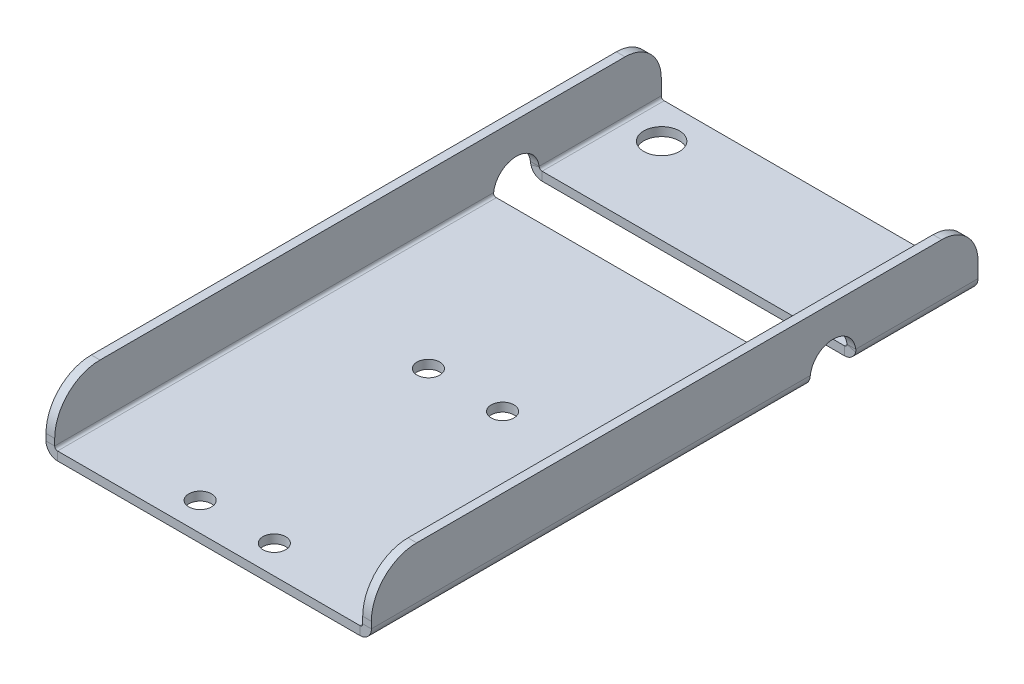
ISO-10303-21;
HEADER;
FILE_DESCRIPTION(('STEP AP214'),'2;1');
FILE_NAME('part.step','',(''),(''),'','','');
FILE_SCHEMA(('AUTOMOTIVE_DESIGN { 1 0 10303 214 1 1 1 1 }'));
ENDSEC;
DATA;
#1=APPLICATION_CONTEXT('core data for automotive mechanical design processes');
#2=APPLICATION_PROTOCOL_DEFINITION('international standard','automotive_design',2000,#1);
#3=PRODUCT_CONTEXT('',#1,'mechanical');
#4=PRODUCT('Part','Part','',(#3));
#5=PRODUCT_RELATED_PRODUCT_CATEGORY('part','',(#4));
#6=PRODUCT_DEFINITION_FORMATION('','',#4);
#7=PRODUCT_DEFINITION_CONTEXT('part definition',#1,'design');
#8=PRODUCT_DEFINITION('design','',#6,#7);
#9=PRODUCT_DEFINITION_SHAPE('','',#8);
#10=(LENGTH_UNIT() NAMED_UNIT(*) SI_UNIT(.MILLI.,.METRE.));
#11=(NAMED_UNIT(*) PLANE_ANGLE_UNIT() SI_UNIT($,.RADIAN.));
#12=(NAMED_UNIT(*) SI_UNIT($,.STERADIAN.) SOLID_ANGLE_UNIT());
#13=UNCERTAINTY_MEASURE_WITH_UNIT(LENGTH_MEASURE(1.E-05),#10,'distance_accuracy_value','');
#14=(GEOMETRIC_REPRESENTATION_CONTEXT(3) GLOBAL_UNCERTAINTY_ASSIGNED_CONTEXT((#13)) GLOBAL_UNIT_ASSIGNED_CONTEXT((#10,
#11,#12)) REPRESENTATION_CONTEXT('',''));
#15=CARTESIAN_POINT('',(0.,0.,0.));
#16=DIRECTION('',(0.,0.,1.));
#17=DIRECTION('',(1.,0.,0.));
#18=AXIS2_PLACEMENT_3D('',#15,#16,#17);
#19=CARTESIAN_POINT('',(0.,0.,-69.0829999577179));
#20=DIRECTION('',(0.,0.,-1.));
#21=DIRECTION('',(-1.,0.,0.));
#22=AXIS2_PLACEMENT_3D('',#19,#20,#21);
#23=PLANE('',#22);
#24=DIRECTION('',(0.,-1.,0.));
#25=VECTOR('',#24,1.);
#26=CARTESIAN_POINT('',(284.569830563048,0.,-69.0829999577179));
#27=LINE('',#26,#25);
#28=CARTESIAN_POINT('',(284.569830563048,83.4722469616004,-69.0829999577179));
#29=VERTEX_POINT('',#28);
#30=CARTESIAN_POINT('',(284.569830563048,77.9952469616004,-69.0829999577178));
#31=VERTEX_POINT('',#30);
#32=EDGE_CURVE('E269',#29,#31,#27,.T.);
#33=ORIENTED_EDGE('',*,*,#32,.F.);
#34=DIRECTION('',(-1.,0.,0.));
#35=VECTOR('',#34,1.);
#36=CARTESIAN_POINT('',(287.617830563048,83.4722469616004,-69.0829999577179));
#37=LINE('',#36,#35);
#38=CARTESIAN_POINT('',(287.617830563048,83.4722469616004,-69.0829999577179));
#39=VERTEX_POINT('',#38);
#40=EDGE_CURVE('E757',#29,#39,#37,.F.);
#41=ORIENTED_EDGE('',*,*,#40,.T.);
#42=DIRECTION('',(0.,-1.,0.));
#43=VECTOR('',#42,1.);
#44=CARTESIAN_POINT('',(287.617830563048,0.,-69.0829999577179));
#45=LINE('',#44,#43);
#46=CARTESIAN_POINT('',(287.617830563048,77.9952469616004,-69.0829999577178));
#47=VERTEX_POINT('',#46);
#48=EDGE_CURVE('E750',#39,#47,#45,.T.);
#49=ORIENTED_EDGE('',*,*,#48,.T.);
#50=CARTESIAN_POINT('',(288.617830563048,77.9952469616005,-69.0829999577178));
#51=DIRECTION('',(0.,0.,-1.));
#52=DIRECTION('',(-1.,0.,0.));
#53=AXIS2_PLACEMENT_3D('',#50,#51,#52);
#54=CIRCLE('',#53,1.);
#55=CARTESIAN_POINT('',(288.617830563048,76.9952469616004,-69.0829999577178));
#56=VERTEX_POINT('',#55);
#57=EDGE_CURVE('E289',#47,#56,#54,.F.);
#58=ORIENTED_EDGE('',*,*,#57,.T.);
#59=DIRECTION('',(1.,0.,0.));
#60=VECTOR('',#59,1.);
#61=CARTESIAN_POINT('',(0.,76.9952469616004,-69.0829999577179));
#62=LINE('',#61,#60);
#63=CARTESIAN_POINT('',(394.567830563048,76.9952469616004,-69.0829999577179));
#64=VERTEX_POINT('',#63);
#65=EDGE_CURVE('E287',#56,#64,#62,.T.);
#66=ORIENTED_EDGE('',*,*,#65,.T.);
#67=CARTESIAN_POINT('',(394.567830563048,77.9952469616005,-69.0829999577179));
#68=DIRECTION('',(0.,0.,-1.));
#69=DIRECTION('',(-1.,0.,0.));
#70=AXIS2_PLACEMENT_3D('',#67,#68,#69);
#71=CIRCLE('',#70,1.00000000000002);
#72=CARTESIAN_POINT('',(395.567830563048,77.9952469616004,-69.0829999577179));
#73=VERTEX_POINT('',#72);
#74=EDGE_CURVE('E276',#64,#73,#71,.F.);
#75=ORIENTED_EDGE('',*,*,#74,.T.);
#76=DIRECTION('',(0.,-1.,0.));
#77=VECTOR('',#76,1.);
#78=CARTESIAN_POINT('',(395.567830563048,0.,-69.0829999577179));
#79=LINE('',#78,#77);
#80=CARTESIAN_POINT('',(395.567830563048,83.4722469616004,-69.0829999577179));
#81=VERTEX_POINT('',#80);
#82=EDGE_CURVE('E258',#81,#73,#79,.T.);
#83=ORIENTED_EDGE('',*,*,#82,.F.);
#84=DIRECTION('',(1.,0.,0.));
#85=VECTOR('',#84,1.);
#86=CARTESIAN_POINT('',(0.,83.4722469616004,-69.0829999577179));
#87=LINE('',#86,#85);
#88=CARTESIAN_POINT('',(398.615830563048,83.4722469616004,-69.0829999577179));
#89=VERTEX_POINT('',#88);
#90=EDGE_CURVE('E760',#81,#89,#87,.T.);
#91=ORIENTED_EDGE('',*,*,#90,.T.);
#92=DIRECTION('',(0.,-1.,0.));
#93=VECTOR('',#92,1.);
#94=CARTESIAN_POINT('',(398.615830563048,0.,-69.0829999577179));
#95=LINE('',#94,#93);
#96=CARTESIAN_POINT('',(398.615830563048,77.9952469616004,-69.0829999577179));
#97=VERTEX_POINT('',#96);
#98=EDGE_CURVE('E270',#89,#97,#95,.T.);
#99=ORIENTED_EDGE('',*,*,#98,.T.);
#100=CARTESIAN_POINT('',(394.567830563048,77.9952469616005,-69.0829999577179));
#101=DIRECTION('',(0.,0.,-1.));
#102=DIRECTION('',(-1.,0.,0.));
#103=AXIS2_PLACEMENT_3D('',#100,#101,#102);
#104=CIRCLE('',#103,4.04799999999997);
#105=CARTESIAN_POINT('',(394.567830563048,73.9472469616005,-69.0829999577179));
#106=VERTEX_POINT('',#105);
#107=EDGE_CURVE('E361',#106,#97,#104,.F.);
#108=ORIENTED_EDGE('',*,*,#107,.F.);
#109=DIRECTION('',(1.,0.,0.));
#110=VECTOR('',#109,1.);
#111=CARTESIAN_POINT('',(0.,73.9472469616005,-69.0829999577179));
#112=LINE('',#111,#110);
#113=CARTESIAN_POINT('',(288.617830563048,73.9472469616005,-69.0829999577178));
#114=VERTEX_POINT('',#113);
#115=EDGE_CURVE('E740',#114,#106,#112,.T.);
#116=ORIENTED_EDGE('',*,*,#115,.F.);
#117=CARTESIAN_POINT('',(288.617830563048,77.9952469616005,-69.0829999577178));
#118=DIRECTION('',(0.,0.,-1.));
#119=DIRECTION('',(-1.,0.,0.));
#120=AXIS2_PLACEMENT_3D('',#117,#118,#119);
#121=CIRCLE('',#120,4.04799999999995);
#122=EDGE_CURVE('E747',#31,#114,#121,.F.);
#123=ORIENTED_EDGE('',*,*,#122,.F.);
#124=EDGE_LOOP('',(#33,#41,#49,#58,#66,#75,#83,#91,#99,#108,#116,#123));
#125=FACE_BOUND('',#124,.T.);
#126=ADVANCED_FACE('F53',(#125),#23,.T.);
#127=CARTESIAN_POINT('',(395.567830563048,0.,0.));
#128=DIRECTION('',(-1.,0.,0.));
#129=DIRECTION('',(0.,0.,1.));
#130=AXIS2_PLACEMENT_3D('',#127,#128,#129);
#131=PLANE('',#130);
#132=DIRECTION('',(0.,0.,1.));
#133=VECTOR('',#132,1.);
#134=CARTESIAN_POINT('',(395.567830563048,96.1722469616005,143.515000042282));
#135=LINE('',#134,#133);
#136=CARTESIAN_POINT('',(395.567830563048,96.1722469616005,-56.3829999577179));
#137=VERTEX_POINT('',#136);
#138=CARTESIAN_POINT('',(395.567830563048,96.1722469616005,127.640000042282));
#139=VERTEX_POINT('',#138);
#140=EDGE_CURVE('E309',#137,#139,#135,.T.);
#141=ORIENTED_EDGE('',*,*,#140,.F.);
#142=CARTESIAN_POINT('',(395.567830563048,83.4722469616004,-56.3829999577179));
#143=DIRECTION('',(-1.,0.,0.));
#144=DIRECTION('',(0.,0.,1.));
#145=AXIS2_PLACEMENT_3D('',#142,#143,#144);
#146=CIRCLE('',#145,12.7);
#147=EDGE_CURVE('E13',#137,#81,#146,.T.);
#148=ORIENTED_EDGE('',*,*,#147,.T.);
#149=ORIENTED_EDGE('',*,*,#82,.T.);
#150=DIRECTION('',(0.,0.,-1.));
#151=VECTOR('',#150,1.);
#152=CARTESIAN_POINT('',(395.567830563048,77.9952469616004,143.515000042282));
#153=LINE('',#152,#151);
#154=CARTESIAN_POINT('',(395.567830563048,77.9952469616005,-26.2468618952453));
#155=VERTEX_POINT('',#154);
#156=EDGE_CURVE('E262',#155,#73,#153,.T.);
#157=ORIENTED_EDGE('',*,*,#156,.F.);
#158=CARTESIAN_POINT('',(395.567830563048,76.9952469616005,-18.2829999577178));
#159=DIRECTION('',(1.,0.,0.));
#160=DIRECTION('',(0.,0.,-1.));
#161=AXIS2_PLACEMENT_3D('',#158,#159,#160);
#162=CIRCLE('',#161,8.0264);
#163=CARTESIAN_POINT('',(395.567830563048,77.9952469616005,-10.3191380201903));
#164=VERTEX_POINT('',#163);
#165=EDGE_CURVE('E438',#155,#164,#162,.T.);
#166=ORIENTED_EDGE('',*,*,#165,.T.);
#167=CARTESIAN_POINT('',(395.567830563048,77.9952469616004,143.515000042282));
#168=VERTEX_POINT('',#167);
#169=EDGE_CURVE('E281',#168,#164,#153,.T.);
#170=ORIENTED_EDGE('',*,*,#169,.F.);
#171=DIRECTION('',(0.,-1.,0.));
#172=VECTOR('',#171,1.);
#173=CARTESIAN_POINT('',(395.567830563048,73.9472469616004,143.515000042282));
#174=LINE('',#173,#172);
#175=CARTESIAN_POINT('',(395.567830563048,80.2972469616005,143.515000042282));
#176=VERTEX_POINT('',#175);
#177=EDGE_CURVE('E342',#176,#168,#174,.T.);
#178=ORIENTED_EDGE('',*,*,#177,.F.);
#179=CARTESIAN_POINT('',(395.567830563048,80.2972469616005,127.640000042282));
#180=DIRECTION('',(1.,0.,0.));
#181=DIRECTION('',(0.,0.,-1.));
#182=AXIS2_PLACEMENT_3D('',#179,#180,#181);
#183=CIRCLE('',#182,15.875);
#184=EDGE_CURVE('E358',#176,#139,#183,.F.);
#185=ORIENTED_EDGE('',*,*,#184,.T.);
#186=EDGE_LOOP('',(#141,#148,#149,#157,#166,#170,#178,#185));
#187=FACE_BOUND('',#186,.T.);
#188=ADVANCED_FACE('F260',(#187),#131,.T.);
#189=CARTESIAN_POINT('',(398.615830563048,0.,0.));
#190=DIRECTION('',(-1.,0.,0.));
#191=DIRECTION('',(0.,0.,1.));
#192=AXIS2_PLACEMENT_3D('',#189,#190,#191);
#193=PLANE('',#192);
#194=ORIENTED_EDGE('',*,*,#98,.F.);
#195=CARTESIAN_POINT('',(398.615830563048,83.4722469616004,-56.3829999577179));
#196=DIRECTION('',(-1.,0.,0.));
#197=DIRECTION('',(0.,0.,1.));
#198=AXIS2_PLACEMENT_3D('',#195,#196,#197);
#199=CIRCLE('',#198,12.7);
#200=CARTESIAN_POINT('',(398.615830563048,96.1722469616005,-56.3829999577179));
#201=VERTEX_POINT('',#200);
#202=EDGE_CURVE('E82',#89,#201,#199,.F.);
#203=ORIENTED_EDGE('',*,*,#202,.T.);
#204=DIRECTION('',(0.,0.,1.));
#205=VECTOR('',#204,1.);
#206=CARTESIAN_POINT('',(398.615830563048,96.1722469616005,143.515000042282));
#207=LINE('',#206,#205);
#208=CARTESIAN_POINT('',(398.615830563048,96.1722469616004,127.640000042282));
#209=VERTEX_POINT('',#208);
#210=EDGE_CURVE('E305',#201,#209,#207,.T.);
#211=ORIENTED_EDGE('',*,*,#210,.T.);
#212=CARTESIAN_POINT('',(398.615830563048,80.2972469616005,127.640000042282));
#213=DIRECTION('',(1.,0.,0.));
#214=DIRECTION('',(0.,0.,-1.));
#215=AXIS2_PLACEMENT_3D('',#212,#213,#214);
#216=CIRCLE('',#215,15.875);
#217=CARTESIAN_POINT('',(398.615830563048,80.2972469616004,143.515000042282));
#218=VERTEX_POINT('',#217);
#219=EDGE_CURVE('E355',#209,#218,#216,.T.);
#220=ORIENTED_EDGE('',*,*,#219,.T.);
#221=DIRECTION('',(0.,-1.,0.));
#222=VECTOR('',#221,1.);
#223=CARTESIAN_POINT('',(398.615830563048,73.9472469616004,143.515000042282));
#224=LINE('',#223,#222);
#225=CARTESIAN_POINT('',(398.615830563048,77.9952469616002,143.515000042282));
#226=VERTEX_POINT('',#225);
#227=EDGE_CURVE('E350',#218,#226,#224,.T.);
#228=ORIENTED_EDGE('',*,*,#227,.T.);
#229=DIRECTION('',(0.,0.,-1.));
#230=VECTOR('',#229,1.);
#231=CARTESIAN_POINT('',(398.615830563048,77.9952469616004,143.515000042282));
#232=LINE('',#231,#230);
#233=CARTESIAN_POINT('',(398.615830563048,77.9952469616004,-10.3191380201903));
#234=VERTEX_POINT('',#233);
#235=EDGE_CURVE('E301',#226,#234,#232,.T.);
#236=ORIENTED_EDGE('',*,*,#235,.T.);
#237=CARTESIAN_POINT('',(398.615830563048,76.9952469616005,-18.2829999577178));
#238=DIRECTION('',(1.,0.,0.));
#239=DIRECTION('',(0.,0.,-1.));
#240=AXIS2_PLACEMENT_3D('',#237,#238,#239);
#241=CIRCLE('',#240,8.0264);
#242=CARTESIAN_POINT('',(398.615830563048,77.9952469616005,-26.2468618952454));
#243=VERTEX_POINT('',#242);
#244=EDGE_CURVE('E441',#243,#234,#241,.T.);
#245=ORIENTED_EDGE('',*,*,#244,.F.);
#246=EDGE_CURVE('E304',#243,#97,#232,.T.);
#247=ORIENTED_EDGE('',*,*,#246,.T.);
#248=EDGE_LOOP('',(#194,#203,#211,#220,#228,#236,#245,#247));
#249=FACE_BOUND('',#248,.T.);
#250=ADVANCED_FACE('F593',(#249),#193,.F.);
#251=CARTESIAN_POINT('',(284.569830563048,0.,0.));
#252=DIRECTION('',(-1.,0.,0.));
#253=DIRECTION('',(0.,0.,-1.));
#254=AXIS2_PLACEMENT_3D('',#251,#252,#253);
#255=PLANE('',#254);
#256=DIRECTION('',(0.,0.,1.));
#257=VECTOR('',#256,1.);
#258=CARTESIAN_POINT('',(284.569830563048,96.1722469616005,143.515000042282));
#259=LINE('',#258,#257);
#260=CARTESIAN_POINT('',(284.569830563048,96.1722469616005,-56.3829999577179));
#261=VERTEX_POINT('',#260);
#262=CARTESIAN_POINT('',(284.569830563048,96.1722469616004,127.640000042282));
#263=VERTEX_POINT('',#262);
#264=EDGE_CURVE('E318',#261,#263,#259,.T.);
#265=ORIENTED_EDGE('',*,*,#264,.F.);
#266=CARTESIAN_POINT('',(284.569830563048,83.4722469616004,-56.3829999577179));
#267=DIRECTION('',(-1.,0.,0.));
#268=DIRECTION('',(0.,0.,1.));
#269=AXIS2_PLACEMENT_3D('',#266,#267,#268);
#270=CIRCLE('',#269,12.7);
#271=EDGE_CURVE('E762',#261,#29,#270,.T.);
#272=ORIENTED_EDGE('',*,*,#271,.T.);
#273=ORIENTED_EDGE('',*,*,#32,.T.);
#274=DIRECTION('',(0.,0.,-1.));
#275=VECTOR('',#274,1.);
#276=CARTESIAN_POINT('',(284.569830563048,77.9952469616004,-407.934999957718));
#277=LINE('',#276,#275);
#278=CARTESIAN_POINT('',(284.569830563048,77.9952469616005,-26.2468618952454));
#279=VERTEX_POINT('',#278);
#280=EDGE_CURVE('E317',#279,#31,#277,.T.);
#281=ORIENTED_EDGE('',*,*,#280,.F.);
#282=CARTESIAN_POINT('',(284.569830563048,76.9952469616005,-18.2829999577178));
#283=DIRECTION('',(-1.,0.,0.));
#284=DIRECTION('',(0.,0.,1.));
#285=AXIS2_PLACEMENT_3D('',#282,#283,#284);
#286=CIRCLE('',#285,8.0264);
#287=CARTESIAN_POINT('',(284.569830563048,77.9952469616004,-10.3191380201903));
#288=VERTEX_POINT('',#287);
#289=EDGE_CURVE('E429',#279,#288,#286,.F.);
#290=ORIENTED_EDGE('',*,*,#289,.T.);
#291=CARTESIAN_POINT('',(284.569830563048,77.9952469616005,143.515000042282));
#292=VERTEX_POINT('',#291);
#293=EDGE_CURVE('E314',#292,#288,#277,.T.);
#294=ORIENTED_EDGE('',*,*,#293,.F.);
#295=DIRECTION('',(0.,-1.,0.));
#296=VECTOR('',#295,1.);
#297=CARTESIAN_POINT('',(284.569830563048,73.9472469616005,143.515000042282));
#298=LINE('',#297,#296);
#299=CARTESIAN_POINT('',(284.569830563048,80.2972469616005,143.515000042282));
#300=VERTEX_POINT('',#299);
#301=EDGE_CURVE('E379',#300,#292,#298,.T.);
#302=ORIENTED_EDGE('',*,*,#301,.F.);
#303=CARTESIAN_POINT('',(284.569830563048,80.2972469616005,127.640000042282));
#304=DIRECTION('',(1.,0.,0.));
#305=DIRECTION('',(0.,0.,-1.));
#306=AXIS2_PLACEMENT_3D('',#303,#304,#305);
#307=CIRCLE('',#306,15.875);
#308=EDGE_CURVE('E372',#263,#300,#307,.T.);
#309=ORIENTED_EDGE('',*,*,#308,.F.);
#310=EDGE_LOOP('',(#265,#272,#273,#281,#290,#294,#302,#309));
#311=FACE_BOUND('',#310,.T.);
#312=ADVANCED_FACE('F596',(#311),#255,.T.);
#313=CARTESIAN_POINT('',(287.617830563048,0.,0.));
#314=DIRECTION('',(-1.,0.,0.));
#315=DIRECTION('',(0.,0.,-1.));
#316=AXIS2_PLACEMENT_3D('',#313,#314,#315);
#317=PLANE('',#316);
#318=ORIENTED_EDGE('',*,*,#48,.F.);
#319=CARTESIAN_POINT('',(287.617830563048,83.4722469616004,-56.3829999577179));
#320=DIRECTION('',(-1.,0.,0.));
#321=DIRECTION('',(0.,0.,1.));
#322=AXIS2_PLACEMENT_3D('',#319,#320,#321);
#323=CIRCLE('',#322,12.7);
#324=CARTESIAN_POINT('',(287.617830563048,96.1722469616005,-56.3829999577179));
#325=VERTEX_POINT('',#324);
#326=EDGE_CURVE('E755',#39,#325,#323,.F.);
#327=ORIENTED_EDGE('',*,*,#326,.T.);
#328=DIRECTION('',(0.,0.,1.));
#329=VECTOR('',#328,1.);
#330=CARTESIAN_POINT('',(287.617830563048,96.1722469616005,143.515000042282));
#331=LINE('',#330,#329);
#332=CARTESIAN_POINT('',(287.617830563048,96.1722469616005,127.640000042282));
#333=VERTEX_POINT('',#332);
#334=EDGE_CURVE('E280',#325,#333,#331,.T.);
#335=ORIENTED_EDGE('',*,*,#334,.T.);
#336=CARTESIAN_POINT('',(287.617830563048,80.2972469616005,127.640000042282));
#337=DIRECTION('',(1.,0.,0.));
#338=DIRECTION('',(0.,0.,-1.));
#339=AXIS2_PLACEMENT_3D('',#336,#337,#338);
#340=CIRCLE('',#339,15.875);
#341=CARTESIAN_POINT('',(287.617830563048,80.2972469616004,143.515000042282));
#342=VERTEX_POINT('',#341);
#343=EDGE_CURVE('E375',#342,#333,#340,.F.);
#344=ORIENTED_EDGE('',*,*,#343,.F.);
#345=DIRECTION('',(0.,-1.,0.));
#346=VECTOR('',#345,1.);
#347=CARTESIAN_POINT('',(287.617830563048,73.9472469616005,143.515000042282));
#348=LINE('',#347,#346);
#349=CARTESIAN_POINT('',(287.617830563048,77.9952469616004,143.515000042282));
#350=VERTEX_POINT('',#349);
#351=EDGE_CURVE('E384',#342,#350,#348,.T.);
#352=ORIENTED_EDGE('',*,*,#351,.T.);
#353=DIRECTION('',(0.,0.,-1.));
#354=VECTOR('',#353,1.);
#355=CARTESIAN_POINT('',(287.617830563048,77.9952469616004,-407.934999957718));
#356=LINE('',#355,#354);
#357=CARTESIAN_POINT('',(287.617830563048,77.9952469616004,-10.3191380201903));
#358=VERTEX_POINT('',#357);
#359=EDGE_CURVE('E310',#350,#358,#356,.T.);
#360=ORIENTED_EDGE('',*,*,#359,.T.);
#361=CARTESIAN_POINT('',(287.617830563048,76.9952469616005,-18.2829999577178));
#362=DIRECTION('',(-1.,0.,0.));
#363=DIRECTION('',(0.,0.,1.));
#364=AXIS2_PLACEMENT_3D('',#361,#362,#363);
#365=CIRCLE('',#364,8.0264);
#366=CARTESIAN_POINT('',(287.617830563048,77.9952469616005,-26.2468618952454));
#367=VERTEX_POINT('',#366);
#368=EDGE_CURVE('E426',#367,#358,#365,.F.);
#369=ORIENTED_EDGE('',*,*,#368,.F.);
#370=EDGE_CURVE('E313',#367,#47,#356,.T.);
#371=ORIENTED_EDGE('',*,*,#370,.T.);
#372=EDGE_LOOP('',(#318,#327,#335,#344,#352,#360,#369,#371));
#373=FACE_BOUND('',#372,.T.);
#374=ADVANCED_FACE('F601',(#373),#317,.F.);
#375=CARTESIAN_POINT('',(354.592830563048,76.9952469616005,53.515000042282));
#376=DIRECTION('',(0.,1.,0.));
#377=DIRECTION('',(0.,0.,1.));
#378=AXIS2_PLACEMENT_3D('',#375,#376,#377);
#379=CYLINDRICAL_SURFACE('',#378,3.98291999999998);
#380=CARTESIAN_POINT('',(354.592830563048,73.9472469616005,53.515000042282));
#381=DIRECTION('',(0.,-1.,0.));
#382=DIRECTION('',(0.,0.,-1.));
#383=AXIS2_PLACEMENT_3D('',#380,#381,#382);
#384=CIRCLE('',#383,3.98291999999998);
#385=CARTESIAN_POINT('',(354.592830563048,73.9472469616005,49.5320800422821));
#386=VERTEX_POINT('',#385);
#387=EDGE_CURVE('E661',#386,#386,#384,.F.);
#388=ORIENTED_EDGE('',*,*,#387,.F.);
#389=EDGE_LOOP('',(#388));
#390=FACE_BOUND('',#389,.T.);
#391=CARTESIAN_POINT('',(354.592830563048,76.9952469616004,53.515000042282));
#392=DIRECTION('',(0.,-1.,0.));
#393=DIRECTION('',(0.,0.,-1.));
#394=AXIS2_PLACEMENT_3D('',#391,#392,#393);
#395=CIRCLE('',#394,3.98291999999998);
#396=CARTESIAN_POINT('',(354.592830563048,76.9952469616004,49.5320800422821));
#397=VERTEX_POINT('',#396);
#398=EDGE_CURVE('E664',#397,#397,#395,.F.);
#399=ORIENTED_EDGE('',*,*,#398,.T.);
#400=EDGE_LOOP('',(#399));
#401=FACE_BOUND('',#400,.T.);
#402=ADVANCED_FACE('F605',(#390,#401),#379,.F.);
#403=CARTESIAN_POINT('',(328.592830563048,76.9952469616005,53.515000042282));
#404=DIRECTION('',(0.,1.,0.));
#405=DIRECTION('',(0.,0.,1.));
#406=AXIS2_PLACEMENT_3D('',#403,#404,#405);
#407=CYLINDRICAL_SURFACE('',#406,3.98291999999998);
#408=CARTESIAN_POINT('',(328.592830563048,73.9472469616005,53.515000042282));
#409=DIRECTION('',(0.,-1.,0.));
#410=DIRECTION('',(0.,0.,-1.));
#411=AXIS2_PLACEMENT_3D('',#408,#409,#410);
#412=CIRCLE('',#411,3.98291999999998);
#413=CARTESIAN_POINT('',(328.592830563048,73.9472469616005,49.5320800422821));
#414=VERTEX_POINT('',#413);
#415=EDGE_CURVE('E670',#414,#414,#412,.F.);
#416=ORIENTED_EDGE('',*,*,#415,.F.);
#417=EDGE_LOOP('',(#416));
#418=FACE_BOUND('',#417,.T.);
#419=CARTESIAN_POINT('',(328.592830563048,76.9952469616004,53.515000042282));
#420=DIRECTION('',(0.,-1.,0.));
#421=DIRECTION('',(0.,0.,-1.));
#422=AXIS2_PLACEMENT_3D('',#419,#420,#421);
#423=CIRCLE('',#422,3.98291999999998);
#424=CARTESIAN_POINT('',(328.592830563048,76.9952469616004,49.5320800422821));
#425=VERTEX_POINT('',#424);
#426=EDGE_CURVE('E666',#425,#425,#423,.F.);
#427=ORIENTED_EDGE('',*,*,#426,.T.);
#428=EDGE_LOOP('',(#427));
#429=FACE_BOUND('',#428,.T.);
#430=ADVANCED_FACE('F55',(#418,#429),#407,.F.);
#431=CARTESIAN_POINT('',(328.592830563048,76.9952469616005,133.515000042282));
#432=DIRECTION('',(0.,1.,0.));
#433=DIRECTION('',(0.,0.,1.));
#434=AXIS2_PLACEMENT_3D('',#431,#432,#433);
#435=CYLINDRICAL_SURFACE('',#434,3.98291999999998);
#436=CARTESIAN_POINT('',(328.592830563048,73.9472469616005,133.515000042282));
#437=DIRECTION('',(0.,-1.,0.));
#438=DIRECTION('',(0.,0.,-1.));
#439=AXIS2_PLACEMENT_3D('',#436,#437,#438);
#440=CIRCLE('',#439,3.98291999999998);
#441=CARTESIAN_POINT('',(328.592830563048,73.9472469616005,129.532080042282));
#442=VERTEX_POINT('',#441);
#443=EDGE_CURVE('E672',#442,#442,#440,.F.);
#444=ORIENTED_EDGE('',*,*,#443,.F.);
#445=EDGE_LOOP('',(#444));
#446=FACE_BOUND('',#445,.T.);
#447=CARTESIAN_POINT('',(328.592830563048,76.9952469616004,133.515000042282));
#448=DIRECTION('',(0.,-1.,0.));
#449=DIRECTION('',(0.,0.,-1.));
#450=AXIS2_PLACEMENT_3D('',#447,#448,#449);
#451=CIRCLE('',#450,3.98291999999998);
#452=CARTESIAN_POINT('',(328.592830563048,76.9952469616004,129.532080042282));
#453=VERTEX_POINT('',#452);
#454=EDGE_CURVE('E57',#453,#453,#451,.F.);
#455=ORIENTED_EDGE('',*,*,#454,.T.);
#456=EDGE_LOOP('',(#455));
#457=FACE_BOUND('',#456,.T.);
#458=ADVANCED_FACE('F648',(#446,#457),#435,.F.);
#459=CARTESIAN_POINT('',(354.592830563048,76.9952469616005,133.515000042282));
#460=DIRECTION('',(0.,1.,0.));
#461=DIRECTION('',(0.,0.,1.));
#462=AXIS2_PLACEMENT_3D('',#459,#460,#461);
#463=CYLINDRICAL_SURFACE('',#462,3.98291999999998);
#464=CARTESIAN_POINT('',(354.592830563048,73.9472469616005,133.515000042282));
#465=DIRECTION('',(0.,-1.,0.));
#466=DIRECTION('',(0.,0.,-1.));
#467=AXIS2_PLACEMENT_3D('',#464,#465,#466);
#468=CIRCLE('',#467,3.98291999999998);
#469=CARTESIAN_POINT('',(354.592830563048,73.9472469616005,129.532080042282));
#470=VERTEX_POINT('',#469);
#471=EDGE_CURVE('E674',#470,#470,#468,.F.);
#472=ORIENTED_EDGE('',*,*,#471,.F.);
#473=EDGE_LOOP('',(#472));
#474=FACE_BOUND('',#473,.T.);
#475=CARTESIAN_POINT('',(354.592830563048,76.9952469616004,133.515000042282));
#476=DIRECTION('',(0.,-1.,0.));
#477=DIRECTION('',(0.,0.,-1.));
#478=AXIS2_PLACEMENT_3D('',#475,#476,#477);
#479=CIRCLE('',#478,3.98291999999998);
#480=CARTESIAN_POINT('',(354.592830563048,76.9952469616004,129.532080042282));
#481=VERTEX_POINT('',#480);
#482=EDGE_CURVE('E323',#481,#481,#479,.F.);
#483=ORIENTED_EDGE('',*,*,#482,.T.);
#484=EDGE_LOOP('',(#483));
#485=FACE_BOUND('',#484,.T.);
#486=ADVANCED_FACE('F644',(#474,#485),#463,.F.);
#487=CARTESIAN_POINT('',(284.569830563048,73.9472469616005,-10.2565999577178));
#488=DIRECTION('',(0.,0.,1.));
#489=DIRECTION('',(-1.,0.,0.));
#490=AXIS2_PLACEMENT_3D('',#487,#488,#489);
#491=PLANE('',#490);
#492=DIRECTION('',(0.,-1.,0.));
#493=VECTOR('',#492,1.);
#494=CARTESIAN_POINT('',(394.567830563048,73.9472469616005,-10.2565999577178));
#495=LINE('',#494,#493);
#496=CARTESIAN_POINT('',(394.567830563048,73.9472469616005,-10.2565999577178));
#497=VERTEX_POINT('',#496);
#498=CARTESIAN_POINT('',(394.567830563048,76.9952469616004,-10.2565999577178));
#499=VERTEX_POINT('',#498);
#500=EDGE_CURVE('E458',#497,#499,#495,.F.);
#501=ORIENTED_EDGE('',*,*,#500,.F.);
#502=DIRECTION('',(-1.,0.,0.));
#503=VECTOR('',#502,1.);
#504=CARTESIAN_POINT('',(284.569830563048,73.9472469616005,-10.2565999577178));
#505=LINE('',#504,#503);
#506=CARTESIAN_POINT('',(288.617830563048,73.9472469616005,-10.2565999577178));
#507=VERTEX_POINT('',#506);
#508=EDGE_CURVE('E469',#497,#507,#505,.T.);
#509=ORIENTED_EDGE('',*,*,#508,.T.);
#510=DIRECTION('',(0.,-1.,0.));
#511=VECTOR('',#510,1.);
#512=CARTESIAN_POINT('',(288.617830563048,73.9472469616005,-10.2565999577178));
#513=LINE('',#512,#511);
#514=CARTESIAN_POINT('',(288.617830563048,76.9952469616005,-10.2565999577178));
#515=VERTEX_POINT('',#514);
#516=EDGE_CURVE('E462',#507,#515,#513,.F.);
#517=ORIENTED_EDGE('',*,*,#516,.T.);
#518=DIRECTION('',(1.,0.,0.));
#519=VECTOR('',#518,1.);
#520=CARTESIAN_POINT('',(0.,76.9952469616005,-10.2565999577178));
#521=LINE('',#520,#519);
#522=EDGE_CURVE('E447',#499,#515,#521,.F.);
#523=ORIENTED_EDGE('',*,*,#522,.F.);
#524=EDGE_LOOP('',(#501,#509,#517,#523));
#525=FACE_BOUND('',#524,.T.);
#526=ADVANCED_FACE('F647',(#525),#491,.F.);
#527=CARTESIAN_POINT('',(395.567830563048,1200.06693657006,143.515000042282));
#528=DIRECTION('',(0.,0.,1.));
#529=DIRECTION('',(1.,0.,0.));
#530=AXIS2_PLACEMENT_3D('',#527,#528,#529);
#531=PLANE('',#530);
#532=DIRECTION('',(0.,-1.,0.));
#533=VECTOR('',#532,1.);
#534=CARTESIAN_POINT('',(288.617830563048,1200.06693657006,143.515000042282));
#535=LINE('',#534,#533);
#536=CARTESIAN_POINT('',(288.617830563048,76.9952469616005,143.515000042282));
#537=VERTEX_POINT('',#536);
#538=CARTESIAN_POINT('',(288.617830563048,73.9472469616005,143.515000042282));
#539=VERTEX_POINT('',#538);
#540=EDGE_CURVE('E394',#537,#539,#535,.T.);
#541=ORIENTED_EDGE('',*,*,#540,.T.);
#542=DIRECTION('',(-1.,0.,0.));
#543=VECTOR('',#542,1.);
#544=CARTESIAN_POINT('',(395.567830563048,73.9472469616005,143.515000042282));
#545=LINE('',#544,#543);
#546=CARTESIAN_POINT('',(394.567830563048,73.9472469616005,143.515000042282));
#547=VERTEX_POINT('',#546);
#548=EDGE_CURVE('E404',#547,#539,#545,.T.);
#549=ORIENTED_EDGE('',*,*,#548,.F.);
#550=DIRECTION('',(0.,-1.,0.));
#551=VECTOR('',#550,1.);
#552=CARTESIAN_POINT('',(394.567830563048,1200.06693657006,143.515000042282));
#553=LINE('',#552,#551);
#554=CARTESIAN_POINT('',(394.567830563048,76.9952469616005,143.515000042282));
#555=VERTEX_POINT('',#554);
#556=EDGE_CURVE('E390',#555,#547,#553,.T.);
#557=ORIENTED_EDGE('',*,*,#556,.F.);
#558=DIRECTION('',(-1.,0.,0.));
#559=VECTOR('',#558,1.);
#560=CARTESIAN_POINT('',(395.567830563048,76.9952469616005,143.515000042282));
#561=LINE('',#560,#559);
#562=EDGE_CURVE('E397',#555,#537,#561,.T.);
#563=ORIENTED_EDGE('',*,*,#562,.T.);
#564=EDGE_LOOP('',(#541,#549,#557,#563));
#565=FACE_BOUND('',#564,.T.);
#566=ADVANCED_FACE('F867',(#565),#531,.T.);
#567=CARTESIAN_POINT('',(394.567830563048,77.9952469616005,143.515000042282));
#568=DIRECTION('',(0.,0.,1.));
#569=DIRECTION('',(1.,0.,0.));
#570=AXIS2_PLACEMENT_3D('',#567,#568,#569);
#571=PLANE('',#570);
#572=DIRECTION('',(1.,0.,0.));
#573=VECTOR('',#572,1.);
#574=CARTESIAN_POINT('',(-757.172092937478,77.9952469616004,143.515000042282));
#575=LINE('',#574,#573);
#576=EDGE_CURVE('E347',#168,#226,#575,.T.);
#577=ORIENTED_EDGE('',*,*,#576,.F.);
#578=CARTESIAN_POINT('',(394.567830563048,77.9952469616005,143.515000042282));
#579=DIRECTION('',(0.,0.,-1.));
#580=DIRECTION('',(-1.,0.,0.));
#581=AXIS2_PLACEMENT_3D('',#578,#579,#580);
#582=CIRCLE('',#581,1.00000000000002);
#583=EDGE_CURVE('E416',#168,#555,#582,.T.);
#584=ORIENTED_EDGE('',*,*,#583,.T.);
#585=ORIENTED_EDGE('',*,*,#556,.T.);
#586=CARTESIAN_POINT('',(394.567830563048,77.9952469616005,143.515000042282));
#587=DIRECTION('',(0.,0.,-1.));
#588=DIRECTION('',(-1.,0.,0.));
#589=AXIS2_PLACEMENT_3D('',#586,#587,#588);
#590=CIRCLE('',#589,4.04799999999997);
#591=EDGE_CURVE('E413',#226,#547,#590,.T.);
#592=ORIENTED_EDGE('',*,*,#591,.F.);
#593=EDGE_LOOP('',(#577,#584,#585,#592));
#594=FACE_BOUND('',#593,.T.);
#595=ADVANCED_FACE('F537',(#594),#571,.T.);
#596=CARTESIAN_POINT('',(394.567830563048,77.9952469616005,-10.2565999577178));
#597=DIRECTION('',(0.,0.,1.));
#598=DIRECTION('',(1.,0.,0.));
#599=AXIS2_PLACEMENT_3D('',#596,#597,#598);
#600=PLANE('',#599);
#601=CARTESIAN_POINT('',(394.567830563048,77.9952469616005,-10.2565999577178));
#602=DIRECTION('',(0.,0.,-1.));
#603=DIRECTION('',(-1.,0.,0.));
#604=AXIS2_PLACEMENT_3D('',#601,#602,#603);
#605=CIRCLE('',#604,4.04799999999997);
#606=CARTESIAN_POINT('',(398.490368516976,76.9952469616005,-10.2565999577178));
#607=VERTEX_POINT('',#606);
#608=EDGE_CURVE('E813',#497,#607,#605,.F.);
#609=ORIENTED_EDGE('',*,*,#608,.F.);
#610=ORIENTED_EDGE('',*,*,#500,.T.);
#611=CARTESIAN_POINT('',(394.567830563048,77.9952469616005,-10.2565999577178));
#612=DIRECTION('',(0.,0.,-1.));
#613=DIRECTION('',(-1.,0.,0.));
#614=AXIS2_PLACEMENT_3D('',#611,#612,#613);
#615=CIRCLE('',#614,0.999999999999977);
#616=CARTESIAN_POINT('',(395.536836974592,77.748211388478,-10.2565999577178));
#617=VERTEX_POINT('',#616);
#618=EDGE_CURVE('E821',#499,#617,#615,.F.);
#619=ORIENTED_EDGE('',*,*,#618,.T.);
#620=DIRECTION('',(0.969006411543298,-0.247035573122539,0.));
#621=VECTOR('',#620,1.);
#622=CARTESIAN_POINT('',(395.536836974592,77.748211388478,-10.2565999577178));
#623=LINE('',#622,#621);
#624=EDGE_CURVE('E827',#607,#617,#623,.F.);
#625=ORIENTED_EDGE('',*,*,#624,.F.);
#626=EDGE_LOOP('',(#609,#610,#619,#625));
#627=FACE_BOUND('',#626,.T.);
#628=ADVANCED_FACE('F532',(#627),#600,.F.);
#629=CARTESIAN_POINT('',(395.507301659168,77.7557410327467,-10.2565999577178));
#630=CARTESIAN_POINT('',(395.527402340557,77.834586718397,-10.2565999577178));
#631=CARTESIAN_POINT('',(395.537350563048,77.9145167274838,-10.276812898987));
#632=CARTESIAN_POINT('',(395.537350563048,77.9952469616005,-10.3191380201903));
#633=CARTESIAN_POINT('',(395.536836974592,77.748211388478,-10.2565999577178));
#634=CARTESIAN_POINT('',(395.557569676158,77.8295361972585,-10.2565999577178));
#635=CARTESIAN_POINT('',(395.567830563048,77.9119782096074,-10.2768128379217));
#636=CARTESIAN_POINT('',(395.567830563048,77.9952469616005,-10.3191380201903));
#637=CARTESIAN_POINT('',(398.490368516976,76.9952469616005,-10.2565999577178));
#638=CARTESIAN_POINT('',(398.5743032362,77.3244840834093,-10.2565999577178));
#639=CARTESIAN_POINT('',(398.615830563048,77.6581264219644,-10.2768067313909));
#640=CARTESIAN_POINT('',(398.615830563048,77.9952469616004,-10.3191380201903));
#641=B_SPLINE_SURFACE_WITH_KNOTS('',1,3,((#629,#630,#631,#632),(#633,#634,#635,#636),(#637,#638,
#639,#640)),.UNSPECIFIED.,.F.,.F.,.F.,(2,1,2),(4,4),(-0.01,0.,1.),(0.,0.0010097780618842),.UNSPECIFIED.);
#642=DIRECTION('',(1.,0.,0.));
#643=VECTOR('',#642,1.);
#644=CARTESIAN_POINT('',(398.615830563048,77.9952469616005,-10.3191380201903));
#645=LINE('',#644,#643);
#646=EDGE_CURVE('E433',#234,#164,#645,.F.);
#647=CARTESIAN_POINT('',(398.490368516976,76.9952469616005,-10.2565999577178));
#648=CARTESIAN_POINT('',(398.511376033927,77.0776204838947,-10.2565920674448));
#649=CARTESIAN_POINT('',(398.529775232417,77.1606611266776,-10.257864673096));
#650=CARTESIAN_POINT('',(398.561304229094,77.3276560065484,-10.2630444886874));
#651=CARTESIAN_POINT('',(398.574433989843,77.4116102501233,-10.2669517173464));
#652=CARTESIAN_POINT('',(398.595222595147,77.5788164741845,-10.2773997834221));
#653=CARTESIAN_POINT('',(398.602956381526,77.662061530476,-10.2839024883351));
#654=CARTESIAN_POINT('',(398.613265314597,77.8286755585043,-10.2995430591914));
#655=CARTESIAN_POINT('',(398.615837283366,77.912044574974,-10.3086825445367));
#656=CARTESIAN_POINT('',(398.615830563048,77.9952469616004,-10.3191380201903));
#657=B_SPLINE_CURVE_WITH_KNOTS('',3,(#647,#648,#649,#650,#651,#652,#653,#654,#655,#656),
.UNSPECIFIED.,.F.,.F.,(4,2,2,2,4),(0.,0.254981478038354,0.509964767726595,0.761332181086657,
1.01285430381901),.UNSPECIFIED.);
#658=EDGE_CURVE('E578',#607,#234,#657,.T.);
#659=CARTESIAN_POINT('',(395.536836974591,77.748211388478,-10.2565999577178));
#660=CARTESIAN_POINT('',(395.542012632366,77.7684588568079,-10.2565675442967));
#661=CARTESIAN_POINT('',(395.54652437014,77.7888604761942,-10.2578516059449));
#662=CARTESIAN_POINT('',(395.554212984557,77.8295104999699,-10.2629308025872));
#663=CARTESIAN_POINT('',(395.557395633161,77.8497591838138,-10.266714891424));
#664=CARTESIAN_POINT('',(395.562642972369,77.8912385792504,-10.2770250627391));
#665=CARTESIAN_POINT('',(395.564613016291,77.9124378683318,-10.2837256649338));
#666=CARTESIAN_POINT('',(395.566561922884,77.9437859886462,-10.2956195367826));
#667=CARTESIAN_POINT('',(395.567043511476,77.9542505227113,-10.2999378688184));
#668=CARTESIAN_POINT('',(395.567677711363,77.9749349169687,-10.3091323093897));
#669=CARTESIAN_POINT('',(395.567830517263,77.9851549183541,-10.3140080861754));
#670=CARTESIAN_POINT('',(395.567830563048,77.9952469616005,-10.3191380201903));
#671=B_SPLINE_CURVE_WITH_KNOTS('',3,(#659,#660,#661,#662,#663,#664,#665,#666,#667,#668,#669,
#670),.UNSPECIFIED.,.F.,.F.,(4,2,2,2,2,4),(0.,0.0626182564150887,0.124961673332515,
0.191700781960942,0.225675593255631,0.259630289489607),.UNSPECIFIED.);
#672=EDGE_CURVE('E577',#617,#164,#671,.T.);
#673=ORIENTED_EDGE('',*,*,#646,.F.);
#674=ORIENTED_EDGE('',*,*,#658,.F.);
#675=ORIENTED_EDGE('',*,*,#624,.T.);
#676=ORIENTED_EDGE('',*,*,#672,.T.);
#677=EDGE_LOOP('',(#673,#674,#675,#676));
#678=FACE_BOUND('',#677,.T.);
#679=ADVANCED_FACE('F536',(#678),#641,.F.);
#680=CARTESIAN_POINT('',(0.,73.9472469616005,0.));
#681=DIRECTION('',(0.,-1.,0.));
#682=DIRECTION('',(0.,0.,-1.));
#683=AXIS2_PLACEMENT_3D('',#680,#681,#682);
#684=PLANE('',#683);
#685=ORIENTED_EDGE('',*,*,#471,.T.);
#686=EDGE_LOOP('',(#685));
#687=FACE_BOUND('',#686,.T.);
#688=ORIENTED_EDGE('',*,*,#443,.T.);
#689=EDGE_LOOP('',(#688));
#690=FACE_BOUND('',#689,.T.);
#691=ORIENTED_EDGE('',*,*,#415,.T.);
#692=EDGE_LOOP('',(#691));
#693=FACE_BOUND('',#692,.T.);
#694=ORIENTED_EDGE('',*,*,#387,.T.);
#695=EDGE_LOOP('',(#694));
#696=FACE_BOUND('',#695,.T.);
#697=DIRECTION('',(0.,0.,-1.));
#698=VECTOR('',#697,1.);
#699=CARTESIAN_POINT('',(288.617830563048,73.9472469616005,-407.934999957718));
#700=LINE('',#699,#698);
#701=EDGE_CURVE('E365',#539,#507,#700,.T.);
#702=ORIENTED_EDGE('',*,*,#701,.T.);
#703=ORIENTED_EDGE('',*,*,#508,.F.);
#704=DIRECTION('',(0.,0.,1.));
#705=VECTOR('',#704,1.);
#706=CARTESIAN_POINT('',(394.567830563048,73.9472469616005,143.515000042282));
#707=LINE('',#706,#705);
#708=EDGE_CURVE('E331',#497,#547,#707,.T.);
#709=ORIENTED_EDGE('',*,*,#708,.T.);
#710=ORIENTED_EDGE('',*,*,#548,.T.);
#711=EDGE_LOOP('',(#702,#703,#709,#710));
#712=FACE_BOUND('',#711,.T.);
#713=ADVANCED_FACE('F615',(#687,#690,#693,#696,#712),#684,.T.);
#714=CARTESIAN_POINT('',(0.,76.9952469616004,0.));
#715=DIRECTION('',(0.,-1.,0.));
#716=DIRECTION('',(0.,0.,-1.));
#717=AXIS2_PLACEMENT_3D('',#714,#715,#716);
#718=PLANE('',#717);
#719=ORIENTED_EDGE('',*,*,#482,.F.);
#720=EDGE_LOOP('',(#719));
#721=FACE_BOUND('',#720,.T.);
#722=ORIENTED_EDGE('',*,*,#454,.F.);
#723=EDGE_LOOP('',(#722));
#724=FACE_BOUND('',#723,.T.);
#725=ORIENTED_EDGE('',*,*,#426,.F.);
#726=EDGE_LOOP('',(#725));
#727=FACE_BOUND('',#726,.T.);
#728=ORIENTED_EDGE('',*,*,#398,.F.);
#729=EDGE_LOOP('',(#728));
#730=FACE_BOUND('',#729,.T.);
#731=ORIENTED_EDGE('',*,*,#522,.T.);
#732=DIRECTION('',(0.,0.,-1.));
#733=VECTOR('',#732,1.);
#734=CARTESIAN_POINT('',(288.617830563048,76.9952469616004,-407.934999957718));
#735=LINE('',#734,#733);
#736=EDGE_CURVE('E324',#537,#515,#735,.T.);
#737=ORIENTED_EDGE('',*,*,#736,.F.);
#738=ORIENTED_EDGE('',*,*,#562,.F.);
#739=DIRECTION('',(0.,0.,1.));
#740=VECTOR('',#739,1.);
#741=CARTESIAN_POINT('',(394.567830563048,76.9952469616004,143.515000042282));
#742=LINE('',#741,#740);
#743=EDGE_CURVE('E322',#499,#555,#742,.T.);
#744=ORIENTED_EDGE('',*,*,#743,.F.);
#745=EDGE_LOOP('',(#731,#737,#738,#744));
#746=FACE_BOUND('',#745,.T.);
#747=ADVANCED_FACE('F510',(#721,#724,#727,#730,#746),#718,.F.);
#748=CARTESIAN_POINT('',(287.648310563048,77.9952469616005,-10.3191380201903));
#749=CARTESIAN_POINT('',(287.648310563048,77.9145167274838,-10.276812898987));
#750=CARTESIAN_POINT('',(287.658258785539,77.834586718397,-10.2565999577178));
#751=CARTESIAN_POINT('',(287.678359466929,77.7557410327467,-10.2565999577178));
#752=CARTESIAN_POINT('',(287.617830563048,77.9952469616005,-10.3191380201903));
#753=CARTESIAN_POINT('',(287.617830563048,77.9119782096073,-10.2768128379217));
#754=CARTESIAN_POINT('',(287.628091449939,77.8295361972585,-10.2565999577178));
#755=CARTESIAN_POINT('',(287.648824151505,77.748211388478,-10.2565999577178));
#756=CARTESIAN_POINT('',(284.569830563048,77.9952469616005,-10.3191380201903));
#757=CARTESIAN_POINT('',(284.569830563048,77.6581264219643,-10.2768067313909));
#758=CARTESIAN_POINT('',(284.611357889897,77.3244840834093,-10.2565999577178));
#759=CARTESIAN_POINT('',(284.695292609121,76.9952469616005,-10.2565999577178));
#760=B_SPLINE_SURFACE_WITH_KNOTS('',1,3,((#748,#749,#750,#751),(#752,#753,#754,#755),(#756,#757,
#758,#759)),.UNSPECIFIED.,.F.,.F.,.F.,(2,1,2),(4,4),(-0.01,0.,1.),(0.,0.00100977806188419),.UNSPECIFIED.);
#761=DIRECTION('',(0.969006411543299,0.247035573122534,0.));
#762=VECTOR('',#761,1.);
#763=CARTESIAN_POINT('',(284.695292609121,76.9952469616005,-10.2565999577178));
#764=LINE('',#763,#762);
#765=CARTESIAN_POINT('',(284.695292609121,76.9952469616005,-10.2565999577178));
#766=VERTEX_POINT('',#765);
#767=CARTESIAN_POINT('',(287.648824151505,77.748211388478,-10.2565999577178));
#768=VERTEX_POINT('',#767);
#769=EDGE_CURVE('E768',#766,#768,#764,.T.);
#770=CARTESIAN_POINT('',(284.569830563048,77.9952469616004,-10.3191380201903));
#771=CARTESIAN_POINT('',(284.56982330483,77.9109003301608,-10.3085382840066));
#772=CARTESIAN_POINT('',(284.572466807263,77.8263816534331,-10.2992915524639));
#773=CARTESIAN_POINT('',(284.583065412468,77.6574241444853,-10.2835046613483));
#774=CARTESIAN_POINT('',(284.591020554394,77.5729853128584,-10.2769645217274));
#775=CARTESIAN_POINT('',(284.612101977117,77.4058064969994,-10.2666650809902));
#776=CARTESIAN_POINT('',(284.62515332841,77.3230594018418,-10.2628676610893));
#777=CARTESIAN_POINT('',(284.656386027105,77.1584073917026,-10.2578306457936));
#778=CARTESIAN_POINT('',(284.674570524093,77.0765030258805,-10.2565926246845));
#779=CARTESIAN_POINT('',(284.695292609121,76.9952469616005,-10.2565999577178));
#780=B_SPLINE_CURVE_WITH_KNOTS('',3,(#770,#771,#772,#773,#774,#775,#776,#777,#778,#779),
.UNSPECIFIED.,.F.,.F.,(4,2,2,2,4),(0.,0.254981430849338,0.509964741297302,0.761332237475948,
1.01285430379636),.UNSPECIFIED.);
#781=EDGE_CURVE('E486',#288,#766,#780,.T.);
#782=DIRECTION('',(-1.,0.,0.));
#783=VECTOR('',#782,1.);
#784=CARTESIAN_POINT('',(284.569830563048,77.9952469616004,-10.3191380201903));
#785=LINE('',#784,#783);
#786=EDGE_CURVE('E419',#288,#358,#785,.F.);
#787=CARTESIAN_POINT('',(287.617830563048,77.9952469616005,-10.3191380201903));
#788=CARTESIAN_POINT('',(287.617823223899,77.9766437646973,-10.3096615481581));
#789=CARTESIAN_POINT('',(287.618349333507,77.9575486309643,-10.301057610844));
#790=CARTESIAN_POINT('',(287.620580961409,77.9186386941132,-10.2859116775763));
#791=CARTESIAN_POINT('',(287.62228594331,77.8988242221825,-10.279368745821));
#792=CARTESIAN_POINT('',(287.625884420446,77.8681318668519,-10.2711669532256));
#793=CARTESIAN_POINT('',(287.627313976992,77.8574238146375,-10.2686570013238));
#794=CARTESIAN_POINT('',(287.630543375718,77.8359300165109,-10.2643327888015));
#795=CARTESIAN_POINT('',(287.632342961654,77.8251443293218,-10.2625180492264));
#796=CARTESIAN_POINT('',(287.636358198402,77.8033156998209,-10.2595718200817));
#797=CARTESIAN_POINT('',(287.638581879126,77.7922721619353,-10.2584556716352));
#798=CARTESIAN_POINT('',(287.643415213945,77.7702067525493,-10.2569678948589));
#799=CARTESIAN_POINT('',(287.646025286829,77.7591849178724,-10.2565970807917));
#800=CARTESIAN_POINT('',(287.648824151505,77.748211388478,-10.2565999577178));
#801=B_SPLINE_CURVE_WITH_KNOTS('',3,(#787,#788,#789,#790,#791,#792,#793,#794,#795,#796,#797,
#798,#799,#800),.UNSPECIFIED.,.F.,.F.,(4,2,2,2,2,2,4),(0.,0.0626726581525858,0.125316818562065,
0.158563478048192,0.191787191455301,0.225717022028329,0.259683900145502),.UNSPECIFIED.);
#802=EDGE_CURVE('E519',#358,#768,#801,.T.);
#803=ORIENTED_EDGE('',*,*,#769,.F.);
#804=ORIENTED_EDGE('',*,*,#781,.F.);
#805=ORIENTED_EDGE('',*,*,#786,.T.);
#806=ORIENTED_EDGE('',*,*,#802,.T.);
#807=EDGE_LOOP('',(#803,#804,#805,#806));
#808=FACE_BOUND('',#807,.T.);
#809=ADVANCED_FACE('F503',(#808),#760,.F.);
#810=CARTESIAN_POINT('',(288.617830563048,77.9952469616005,-10.2565999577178));
#811=DIRECTION('',(0.,0.,1.));
#812=DIRECTION('',(1.,0.,0.));
#813=AXIS2_PLACEMENT_3D('',#810,#811,#812);
#814=PLANE('',#813);
#815=ORIENTED_EDGE('',*,*,#516,.F.);
#816=CARTESIAN_POINT('',(288.617830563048,77.9952469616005,-10.2565999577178));
#817=DIRECTION('',(0.,0.,-1.));
#818=DIRECTION('',(-1.,0.,0.));
#819=AXIS2_PLACEMENT_3D('',#816,#817,#818);
#820=CIRCLE('',#819,4.04799999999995);
#821=EDGE_CURVE('E524',#766,#507,#820,.F.);
#822=ORIENTED_EDGE('',*,*,#821,.F.);
#823=ORIENTED_EDGE('',*,*,#769,.T.);
#824=CARTESIAN_POINT('',(288.617830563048,77.9952469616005,-10.2565999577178));
#825=DIRECTION('',(0.,0.,1.));
#826=DIRECTION('',(1.,0.,0.));
#827=AXIS2_PLACEMENT_3D('',#824,#825,#826);
#828=CIRCLE('',#827,0.999999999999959);
#829=EDGE_CURVE('E709',#768,#515,#828,.T.);
#830=ORIENTED_EDGE('',*,*,#829,.T.);
#831=EDGE_LOOP('',(#815,#822,#823,#830));
#832=FACE_BOUND('',#831,.T.);
#833=ADVANCED_FACE('F509',(#832),#814,.F.);
#834=CARTESIAN_POINT('',(288.617830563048,77.9952469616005,143.515000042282));
#835=DIRECTION('',(0.,0.,1.));
#836=DIRECTION('',(1.,0.,0.));
#837=AXIS2_PLACEMENT_3D('',#834,#835,#836);
#838=PLANE('',#837);
#839=CARTESIAN_POINT('',(288.617830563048,77.9952469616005,143.515000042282));
#840=DIRECTION('',(0.,0.,1.));
#841=DIRECTION('',(1.,0.,0.));
#842=AXIS2_PLACEMENT_3D('',#839,#840,#841);
#843=CIRCLE('',#842,1.);
#844=EDGE_CURVE('E410',#537,#350,#843,.F.);
#845=ORIENTED_EDGE('',*,*,#844,.T.);
#846=DIRECTION('',(-1.,0.,0.));
#847=VECTOR('',#846,1.);
#848=CARTESIAN_POINT('',(1440.35775406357,77.9952469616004,143.515000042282));
#849=LINE('',#848,#847);
#850=EDGE_CURVE('E362',#350,#292,#849,.T.);
#851=ORIENTED_EDGE('',*,*,#850,.T.);
#852=CARTESIAN_POINT('',(288.617830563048,77.9952469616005,143.515000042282));
#853=DIRECTION('',(0.,0.,1.));
#854=DIRECTION('',(1.,0.,0.));
#855=AXIS2_PLACEMENT_3D('',#852,#853,#854);
#856=CIRCLE('',#855,4.04799999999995);
#857=EDGE_CURVE('E393',#539,#292,#856,.F.);
#858=ORIENTED_EDGE('',*,*,#857,.F.);
#859=ORIENTED_EDGE('',*,*,#540,.F.);
#860=EDGE_LOOP('',(#845,#851,#858,#859));
#861=FACE_BOUND('',#860,.T.);
#862=ADVANCED_FACE('F864',(#861),#838,.T.);
#863=CARTESIAN_POINT('',(394.567830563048,77.9952469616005,856.8670478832));
#864=DIRECTION('',(0.,0.,-1.));
#865=DIRECTION('',(-1.,0.,0.));
#866=AXIS2_PLACEMENT_3D('',#863,#864,#865);
#867=CYLINDRICAL_SURFACE('',#866,4.04799999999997);
#868=ORIENTED_EDGE('',*,*,#608,.T.);
#869=ORIENTED_EDGE('',*,*,#658,.T.);
#870=ORIENTED_EDGE('',*,*,#235,.F.);
#871=ORIENTED_EDGE('',*,*,#591,.T.);
#872=ORIENTED_EDGE('',*,*,#708,.F.);
#873=EDGE_LOOP('',(#868,#869,#870,#871,#872));
#874=FACE_BOUND('',#873,.T.);
#875=ADVANCED_FACE('F632',(#874),#867,.T.);
#876=CARTESIAN_POINT('',(-757.172092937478,96.1722469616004,143.515000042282));
#877=DIRECTION('',(0.,1.,0.));
#878=DIRECTION('',(-1.,0.,0.));
#879=AXIS2_PLACEMENT_3D('',#876,#877,#878);
#880=PLANE('',#879);
#881=ORIENTED_EDGE('',*,*,#210,.F.);
#882=DIRECTION('',(1.,0.,0.));
#883=VECTOR('',#882,1.);
#884=CARTESIAN_POINT('',(-757.172092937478,96.1722469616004,-56.3829999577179));
#885=LINE('',#884,#883);
#886=EDGE_CURVE('E63',#201,#137,#885,.F.);
#887=ORIENTED_EDGE('',*,*,#886,.T.);
#888=ORIENTED_EDGE('',*,*,#140,.T.);
#889=DIRECTION('',(1.,0.,0.));
#890=VECTOR('',#889,1.);
#891=CARTESIAN_POINT('',(-757.172092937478,96.1722469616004,127.640000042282));
#892=LINE('',#891,#890);
#893=EDGE_CURVE('E336',#139,#209,#892,.T.);
#894=ORIENTED_EDGE('',*,*,#893,.T.);
#895=EDGE_LOOP('',(#881,#887,#888,#894));
#896=FACE_BOUND('',#895,.T.);
#897=ADVANCED_FACE('F883',(#896),#880,.T.);
#898=CARTESIAN_POINT('',(-757.172092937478,80.2972469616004,127.640000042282));
#899=DIRECTION('',(1.,0.,0.));
#900=DIRECTION('',(0.,1.,0.));
#901=AXIS2_PLACEMENT_3D('',#898,#899,#900);
#902=CYLINDRICAL_SURFACE('',#901,15.875);
#903=DIRECTION('',(1.,0.,0.));
#904=VECTOR('',#903,1.);
#905=CARTESIAN_POINT('',(-757.172092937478,80.2972469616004,143.515000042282));
#906=LINE('',#905,#904);
#907=EDGE_CURVE('E339',#176,#218,#906,.T.);
#908=ORIENTED_EDGE('',*,*,#907,.T.);
#909=ORIENTED_EDGE('',*,*,#219,.F.);
#910=ORIENTED_EDGE('',*,*,#893,.F.);
#911=ORIENTED_EDGE('',*,*,#184,.F.);
#912=EDGE_LOOP('',(#908,#909,#910,#911));
#913=FACE_BOUND('',#912,.T.);
#914=ADVANCED_FACE('F881',(#913),#902,.T.);
#915=CARTESIAN_POINT('',(-757.172092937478,73.9472469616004,143.515000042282));
#916=DIRECTION('',(0.,0.,1.));
#917=DIRECTION('',(0.,1.,0.));
#918=AXIS2_PLACEMENT_3D('',#915,#916,#917);
#919=PLANE('',#918);
#920=ORIENTED_EDGE('',*,*,#227,.F.);
#921=ORIENTED_EDGE('',*,*,#907,.F.);
#922=ORIENTED_EDGE('',*,*,#177,.T.);
#923=ORIENTED_EDGE('',*,*,#576,.T.);
#924=EDGE_LOOP('',(#920,#921,#922,#923));
#925=FACE_BOUND('',#924,.T.);
#926=ADVANCED_FACE('F878',(#925),#919,.T.);
#927=CARTESIAN_POINT('',(394.567830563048,77.9952469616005,856.8670478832));
#928=DIRECTION('',(0.,0.,-1.));
#929=DIRECTION('',(-1.,0.,0.));
#930=AXIS2_PLACEMENT_3D('',#927,#928,#929);
#931=CYLINDRICAL_SURFACE('',#930,1.00000000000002);
#932=ORIENTED_EDGE('',*,*,#672,.F.);
#933=ORIENTED_EDGE('',*,*,#618,.F.);
#934=ORIENTED_EDGE('',*,*,#743,.T.);
#935=ORIENTED_EDGE('',*,*,#583,.F.);
#936=ORIENTED_EDGE('',*,*,#169,.T.);
#937=EDGE_LOOP('',(#932,#933,#934,#935,#936));
#938=FACE_BOUND('',#937,.T.);
#939=ADVANCED_FACE('F635',(#938),#931,.F.);
#940=CARTESIAN_POINT('',(398.615830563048,76.9952469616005,-18.2829999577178));
#941=DIRECTION('',(1.,0.,0.));
#942=DIRECTION('',(0.,0.,-1.));
#943=AXIS2_PLACEMENT_3D('',#940,#941,#942);
#944=CYLINDRICAL_SURFACE('',#943,8.0264);
#945=ORIENTED_EDGE('',*,*,#244,.T.);
#946=ORIENTED_EDGE('',*,*,#646,.T.);
#947=ORIENTED_EDGE('',*,*,#165,.F.);
#948=DIRECTION('',(1.,0.,0.));
#949=VECTOR('',#948,1.);
#950=CARTESIAN_POINT('',(398.615830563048,77.9952469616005,-26.2468618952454));
#951=LINE('',#950,#949);
#952=EDGE_CURVE('E435',#243,#155,#951,.F.);
#953=ORIENTED_EDGE('',*,*,#952,.F.);
#954=EDGE_LOOP('',(#945,#946,#947,#953));
#955=FACE_BOUND('',#954,.T.);
#956=ADVANCED_FACE('F801',(#955),#944,.F.);
#957=CARTESIAN_POINT('',(288.617830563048,77.9952469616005,-1191.58142803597));
#958=DIRECTION('',(0.,0.,1.));
#959=DIRECTION('',(1.,0.,0.));
#960=AXIS2_PLACEMENT_3D('',#957,#958,#959);
#961=CYLINDRICAL_SURFACE('',#960,4.04799999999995);
#962=ORIENTED_EDGE('',*,*,#781,.T.);
#963=ORIENTED_EDGE('',*,*,#821,.T.);
#964=ORIENTED_EDGE('',*,*,#701,.F.);
#965=ORIENTED_EDGE('',*,*,#857,.T.);
#966=ORIENTED_EDGE('',*,*,#293,.T.);
#967=EDGE_LOOP('',(#962,#963,#964,#965,#966));
#968=FACE_BOUND('',#967,.T.);
#969=ADVANCED_FACE('F622',(#968),#961,.T.);
#970=CARTESIAN_POINT('',(284.569830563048,76.9952469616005,-18.2829999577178));
#971=DIRECTION('',(-1.,0.,0.));
#972=DIRECTION('',(0.,0.,1.));
#973=AXIS2_PLACEMENT_3D('',#970,#971,#972);
#974=CYLINDRICAL_SURFACE('',#973,8.0264);
#975=ORIENTED_EDGE('',*,*,#786,.F.);
#976=ORIENTED_EDGE('',*,*,#289,.F.);
#977=DIRECTION('',(-1.,0.,0.));
#978=VECTOR('',#977,1.);
#979=CARTESIAN_POINT('',(284.569830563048,77.9952469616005,-26.2468618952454));
#980=LINE('',#979,#978);
#981=EDGE_CURVE('E422',#279,#367,#980,.F.);
#982=ORIENTED_EDGE('',*,*,#981,.T.);
#983=ORIENTED_EDGE('',*,*,#368,.T.);
#984=EDGE_LOOP('',(#975,#976,#982,#983));
#985=FACE_BOUND('',#984,.T.);
#986=ADVANCED_FACE('F909',(#985),#974,.F.);
#987=CARTESIAN_POINT('',(288.617830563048,77.9952469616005,-1191.58142803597));
#988=DIRECTION('',(0.,0.,1.));
#989=DIRECTION('',(1.,0.,0.));
#990=AXIS2_PLACEMENT_3D('',#987,#988,#989);
#991=CYLINDRICAL_SURFACE('',#990,1.);
#992=ORIENTED_EDGE('',*,*,#829,.F.);
#993=ORIENTED_EDGE('',*,*,#802,.F.);
#994=ORIENTED_EDGE('',*,*,#359,.F.);
#995=ORIENTED_EDGE('',*,*,#844,.F.);
#996=ORIENTED_EDGE('',*,*,#736,.T.);
#997=EDGE_LOOP('',(#992,#993,#994,#995,#996));
#998=FACE_BOUND('',#997,.T.);
#999=ADVANCED_FACE('F627',(#998),#991,.F.);
#1000=CARTESIAN_POINT('',(1440.35775406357,73.9472469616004,143.515000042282));
#1001=DIRECTION('',(0.,0.,-1.));
#1002=DIRECTION('',(0.,1.,0.));
#1003=AXIS2_PLACEMENT_3D('',#1000,#1001,#1002);
#1004=PLANE('',#1003);
#1005=ORIENTED_EDGE('',*,*,#301,.T.);
#1006=ORIENTED_EDGE('',*,*,#850,.F.);
#1007=ORIENTED_EDGE('',*,*,#351,.F.);
#1008=DIRECTION('',(-1.,0.,0.));
#1009=VECTOR('',#1008,1.);
#1010=CARTESIAN_POINT('',(1440.35775406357,80.2972469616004,143.515000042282));
#1011=LINE('',#1010,#1009);
#1012=EDGE_CURVE('E382',#342,#300,#1011,.T.);
#1013=ORIENTED_EDGE('',*,*,#1012,.T.);
#1014=EDGE_LOOP('',(#1005,#1006,#1007,#1013));
#1015=FACE_BOUND('',#1014,.T.);
#1016=ADVANCED_FACE('F860',(#1015),#1004,.F.);
#1017=CARTESIAN_POINT('',(1440.35775406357,80.2972469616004,127.640000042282));
#1018=DIRECTION('',(-1.,0.,0.));
#1019=DIRECTION('',(0.,-1.,0.));
#1020=AXIS2_PLACEMENT_3D('',#1017,#1018,#1019);
#1021=CYLINDRICAL_SURFACE('',#1020,15.875);
#1022=DIRECTION('',(-1.,0.,0.));
#1023=VECTOR('',#1022,1.);
#1024=CARTESIAN_POINT('',(1440.35775406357,96.1722469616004,127.640000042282));
#1025=LINE('',#1024,#1023);
#1026=EDGE_CURVE('E368',#333,#263,#1025,.T.);
#1027=ORIENTED_EDGE('',*,*,#1026,.T.);
#1028=ORIENTED_EDGE('',*,*,#308,.T.);
#1029=ORIENTED_EDGE('',*,*,#1012,.F.);
#1030=ORIENTED_EDGE('',*,*,#343,.T.);
#1031=EDGE_LOOP('',(#1027,#1028,#1029,#1030));
#1032=FACE_BOUND('',#1031,.T.);
#1033=ADVANCED_FACE('F895',(#1032),#1021,.T.);
#1034=CARTESIAN_POINT('',(1440.35775406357,96.1722469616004,143.515000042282));
#1035=DIRECTION('',(0.,-1.,0.));
#1036=DIRECTION('',(1.,0.,0.));
#1037=AXIS2_PLACEMENT_3D('',#1034,#1035,#1036);
#1038=PLANE('',#1037);
#1039=ORIENTED_EDGE('',*,*,#334,.F.);
#1040=DIRECTION('',(-1.,0.,0.));
#1041=VECTOR('',#1040,1.);
#1042=CARTESIAN_POINT('',(284.569830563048,96.1722469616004,-56.3829999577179));
#1043=LINE('',#1042,#1041);
#1044=EDGE_CURVE('E725',#325,#261,#1043,.T.);
#1045=ORIENTED_EDGE('',*,*,#1044,.T.);
#1046=ORIENTED_EDGE('',*,*,#264,.T.);
#1047=ORIENTED_EDGE('',*,*,#1026,.F.);
#1048=EDGE_LOOP('',(#1039,#1045,#1046,#1047));
#1049=FACE_BOUND('',#1048,.T.);
#1050=ADVANCED_FACE('F898',(#1049),#1038,.F.);
#1051=CARTESIAN_POINT('',(284.569830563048,73.9472469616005,-26.3093999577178));
#1052=DIRECTION('',(0.,0.,1.));
#1053=DIRECTION('',(-1.,0.,0.));
#1054=AXIS2_PLACEMENT_3D('',#1051,#1052,#1053);
#1055=PLANE('',#1054);
#1056=DIRECTION('',(0.,-1.,0.));
#1057=VECTOR('',#1056,1.);
#1058=CARTESIAN_POINT('',(288.617830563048,73.9472469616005,-26.3093999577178));
#1059=LINE('',#1058,#1057);
#1060=CARTESIAN_POINT('',(288.617830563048,73.9472469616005,-26.3093999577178));
#1061=VERTEX_POINT('',#1060);
#1062=CARTESIAN_POINT('',(288.617830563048,76.9952469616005,-26.3093999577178));
#1063=VERTEX_POINT('',#1062);
#1064=EDGE_CURVE('E443',#1061,#1063,#1059,.F.);
#1065=ORIENTED_EDGE('',*,*,#1064,.F.);
#1066=DIRECTION('',(-1.,0.,0.));
#1067=VECTOR('',#1066,1.);
#1068=CARTESIAN_POINT('',(284.569830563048,73.9472469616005,-26.3093999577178));
#1069=LINE('',#1068,#1067);
#1070=CARTESIAN_POINT('',(394.567830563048,73.9472469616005,-26.3093999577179));
#1071=VERTEX_POINT('',#1070);
#1072=EDGE_CURVE('E451',#1071,#1061,#1069,.T.);
#1073=ORIENTED_EDGE('',*,*,#1072,.F.);
#1074=DIRECTION('',(0.,-1.,0.));
#1075=VECTOR('',#1074,1.);
#1076=CARTESIAN_POINT('',(394.567830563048,73.9472469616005,-26.3093999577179));
#1077=LINE('',#1076,#1075);
#1078=CARTESIAN_POINT('',(394.567830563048,76.9952469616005,-26.3093999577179));
#1079=VERTEX_POINT('',#1078);
#1080=EDGE_CURVE('E455',#1071,#1079,#1077,.F.);
#1081=ORIENTED_EDGE('',*,*,#1080,.T.);
#1082=DIRECTION('',(1.,0.,0.));
#1083=VECTOR('',#1082,1.);
#1084=CARTESIAN_POINT('',(0.,76.9952469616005,-26.3093999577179));
#1085=LINE('',#1084,#1083);
#1086=EDGE_CURVE('E452',#1079,#1063,#1085,.F.);
#1087=ORIENTED_EDGE('',*,*,#1086,.T.);
#1088=EDGE_LOOP('',(#1065,#1073,#1081,#1087));
#1089=FACE_BOUND('',#1088,.T.);
#1090=ADVANCED_FACE('F550',(#1089),#1055,.T.);
#1091=CARTESIAN_POINT('',(395.537350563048,77.9952469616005,-26.2468618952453));
#1092=CARTESIAN_POINT('',(395.537350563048,77.9145167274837,-26.2891870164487));
#1093=CARTESIAN_POINT('',(395.527402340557,77.8345867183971,-26.3093999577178));
#1094=CARTESIAN_POINT('',(395.507301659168,77.7557410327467,-26.3093999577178));
#1095=CARTESIAN_POINT('',(395.567830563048,77.9952469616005,-26.2468618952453));
#1096=CARTESIAN_POINT('',(395.567830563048,77.9119782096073,-26.289187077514));
#1097=CARTESIAN_POINT('',(395.557569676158,77.8295361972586,-26.3093999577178));
#1098=CARTESIAN_POINT('',(395.536836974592,77.748211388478,-26.3093999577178));
#1099=CARTESIAN_POINT('',(398.615830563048,77.9952469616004,-26.2468618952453));
#1100=CARTESIAN_POINT('',(398.615830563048,77.6581264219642,-26.2891931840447));
#1101=CARTESIAN_POINT('',(398.5743032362,77.3244840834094,-26.3093999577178));
#1102=CARTESIAN_POINT('',(398.490368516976,76.9952469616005,-26.3093999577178));
#1103=B_SPLINE_SURFACE_WITH_KNOTS('',1,3,((#1091,#1092,#1093,#1094),(#1095,#1096,#1097,#1098),
(#1099,#1100,#1101,#1102)),.UNSPECIFIED.,.F.,.F.,.F.,(2,1,2),(4,4),(-0.01,0.,1.),(0.,
0.00100977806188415),.UNSPECIFIED.);
#1104=DIRECTION('',(-0.969006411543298,0.247035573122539,0.));
#1105=VECTOR('',#1104,1.);
#1106=CARTESIAN_POINT('',(398.490368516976,76.9952469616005,-26.3093999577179));
#1107=LINE('',#1106,#1105);
#1108=CARTESIAN_POINT('',(398.490368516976,76.9952469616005,-26.3093999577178));
#1109=VERTEX_POINT('',#1108);
#1110=CARTESIAN_POINT('',(395.536836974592,77.748211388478,-26.3093999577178));
#1111=VERTEX_POINT('',#1110);
#1112=EDGE_CURVE('E494',#1109,#1111,#1107,.T.);
#1113=CARTESIAN_POINT('',(398.615830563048,77.9952469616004,-26.2468618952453));
#1114=CARTESIAN_POINT('',(398.615837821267,77.9109003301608,-26.2574616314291));
#1115=CARTESIAN_POINT('',(398.613194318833,77.826381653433,-26.2667083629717));
#1116=CARTESIAN_POINT('',(398.602595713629,77.6574241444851,-26.2824952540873));
#1117=CARTESIAN_POINT('',(398.594640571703,77.5729853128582,-26.2890353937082));
#1118=CARTESIAN_POINT('',(398.57355914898,77.4058064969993,-26.2993348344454));
#1119=CARTESIAN_POINT('',(398.560507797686,77.3230594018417,-26.3031322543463));
#1120=CARTESIAN_POINT('',(398.529275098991,77.1584073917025,-26.308169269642));
#1121=CARTESIAN_POINT('',(398.511090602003,77.0765030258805,-26.3094072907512));
#1122=CARTESIAN_POINT('',(398.490368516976,76.9952469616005,-26.3093999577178));
#1123=B_SPLINE_CURVE_WITH_KNOTS('',3,(#1113,#1114,#1115,#1116,#1117,#1118,#1119,#1120,#1121,
#1122),.UNSPECIFIED.,.F.,.F.,(4,2,2,2,4),(0.,0.25498143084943,0.509964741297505,
0.761332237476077,1.01285430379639),.UNSPECIFIED.);
#1124=EDGE_CURVE('E570',#243,#1109,#1123,.T.);
#1125=CARTESIAN_POINT('',(395.567830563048,77.9952469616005,-26.2468618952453));
#1126=CARTESIAN_POINT('',(395.567837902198,77.9766437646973,-26.2563383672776));
#1127=CARTESIAN_POINT('',(395.56731179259,77.9575486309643,-26.2649423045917));
#1128=CARTESIAN_POINT('',(395.565080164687,77.9186386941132,-26.2800882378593));
#1129=CARTESIAN_POINT('',(395.563375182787,77.8988242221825,-26.2866311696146));
#1130=CARTESIAN_POINT('',(395.559776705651,77.8681318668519,-26.29483296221));
#1131=CARTESIAN_POINT('',(395.558347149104,77.8574238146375,-26.2973429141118));
#1132=CARTESIAN_POINT('',(395.555117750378,77.8359300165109,-26.3016671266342));
#1133=CARTESIAN_POINT('',(395.553318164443,77.8251443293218,-26.3034818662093));
#1134=CARTESIAN_POINT('',(395.549302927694,77.8033156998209,-26.3064280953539));
#1135=CARTESIAN_POINT('',(395.547079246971,77.7922721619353,-26.3075442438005));
#1136=CARTESIAN_POINT('',(395.542245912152,77.7702067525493,-26.3090320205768));
#1137=CARTESIAN_POINT('',(395.539635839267,77.7591849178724,-26.3094028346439));
#1138=CARTESIAN_POINT('',(395.536836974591,77.748211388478,-26.3093999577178));
#1139=B_SPLINE_CURVE_WITH_KNOTS('',3,(#1125,#1126,#1127,#1128,#1129,#1130,#1131,#1132,#1133,
#1134,#1135,#1136,#1137,#1138),.UNSPECIFIED.,.F.,.F.,(4,2,2,2,2,2,4),(0.,0.0626726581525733,
0.125316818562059,0.158563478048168,0.191787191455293,0.225717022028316,0.259683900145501),.UNSPECIFIED.);
#1140=EDGE_CURVE('E278',#155,#1111,#1139,.T.);
#1141=ORIENTED_EDGE('',*,*,#1112,.F.);
#1142=ORIENTED_EDGE('',*,*,#1124,.F.);
#1143=ORIENTED_EDGE('',*,*,#952,.T.);
#1144=ORIENTED_EDGE('',*,*,#1140,.T.);
#1145=EDGE_LOOP('',(#1141,#1142,#1143,#1144));
#1146=FACE_BOUND('',#1145,.T.);
#1147=ADVANCED_FACE('F543',(#1146),#1103,.F.);
#1148=CARTESIAN_POINT('',(394.567830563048,77.9952469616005,-26.3093999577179));
#1149=DIRECTION('',(0.,0.,-1.));
#1150=DIRECTION('',(-1.,0.,0.));
#1151=AXIS2_PLACEMENT_3D('',#1148,#1149,#1150);
#1152=PLANE('',#1151);
#1153=ORIENTED_EDGE('',*,*,#1080,.F.);
#1154=CARTESIAN_POINT('',(394.567830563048,77.9952469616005,-26.3093999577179));
#1155=DIRECTION('',(0.,0.,1.));
#1156=DIRECTION('',(1.,0.,0.));
#1157=AXIS2_PLACEMENT_3D('',#1154,#1155,#1156);
#1158=CIRCLE('',#1157,4.04799999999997);
#1159=EDGE_CURVE('E576',#1109,#1071,#1158,.F.);
#1160=ORIENTED_EDGE('',*,*,#1159,.F.);
#1161=ORIENTED_EDGE('',*,*,#1112,.T.);
#1162=CARTESIAN_POINT('',(394.567830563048,77.9952469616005,-26.3093999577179));
#1163=DIRECTION('',(0.,0.,-1.));
#1164=DIRECTION('',(-1.,0.,0.));
#1165=AXIS2_PLACEMENT_3D('',#1162,#1163,#1164);
#1166=CIRCLE('',#1165,0.999999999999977);
#1167=EDGE_CURVE('E823',#1111,#1079,#1166,.T.);
#1168=ORIENTED_EDGE('',*,*,#1167,.T.);
#1169=EDGE_LOOP('',(#1153,#1160,#1161,#1168));
#1170=FACE_BOUND('',#1169,.T.);
#1171=ADVANCED_FACE('F539',(#1170),#1152,.F.);
#1172=CARTESIAN_POINT('',(300.444830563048,76.9952469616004,-56.3829999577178));
#1173=DIRECTION('',(0.,-1.,0.));
#1174=DIRECTION('',(0.,0.,-1.));
#1175=AXIS2_PLACEMENT_3D('',#1172,#1173,#1174);
#1176=CIRCLE('',#1175,6.25);
#1177=CARTESIAN_POINT('',(300.444830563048,76.9952469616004,-62.6329999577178));
#1178=VERTEX_POINT('',#1177);
#1179=EDGE_CURVE('E290',#1178,#1178,#1176,.F.);
#1180=ORIENTED_EDGE('',*,*,#1179,.F.);
#1181=EDGE_LOOP('',(#1180));
#1182=FACE_BOUND('',#1181,.T.);
#1183=ORIENTED_EDGE('',*,*,#65,.F.);
#1184=EDGE_CURVE('E403',#1063,#56,#735,.T.);
#1185=ORIENTED_EDGE('',*,*,#1184,.F.);
#1186=ORIENTED_EDGE('',*,*,#1086,.F.);
#1187=EDGE_CURVE('E319',#64,#1079,#742,.T.);
#1188=ORIENTED_EDGE('',*,*,#1187,.F.);
#1189=EDGE_LOOP('',(#1183,#1185,#1186,#1188));
#1190=FACE_BOUND('',#1189,.T.);
#1191=ADVANCED_FACE('F542',(#1182,#1190),#718,.F.);
#1192=ORIENTED_EDGE('',*,*,#74,.F.);
#1193=ORIENTED_EDGE('',*,*,#1187,.T.);
#1194=ORIENTED_EDGE('',*,*,#1167,.F.);
#1195=ORIENTED_EDGE('',*,*,#1140,.F.);
#1196=ORIENTED_EDGE('',*,*,#156,.T.);
#1197=EDGE_LOOP('',(#1192,#1193,#1194,#1195,#1196));
#1198=FACE_BOUND('',#1197,.T.);
#1199=ADVANCED_FACE('F275',(#1198),#931,.F.);
#1200=CARTESIAN_POINT('',(300.444830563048,73.9472469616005,-56.3829999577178));
#1201=DIRECTION('',(0.,-1.,0.));
#1202=DIRECTION('',(0.,0.,-1.));
#1203=AXIS2_PLACEMENT_3D('',#1200,#1201,#1202);
#1204=CIRCLE('',#1203,6.25);
#1205=CARTESIAN_POINT('',(300.444830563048,73.9472469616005,-62.6329999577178));
#1206=VERTEX_POINT('',#1205);
#1207=EDGE_CURVE('E297',#1206,#1206,#1204,.T.);
#1208=ORIENTED_EDGE('',*,*,#1207,.F.);
#1209=EDGE_LOOP('',(#1208));
#1210=FACE_BOUND('',#1209,.T.);
#1211=EDGE_CURVE('E409',#1061,#114,#700,.T.);
#1212=ORIENTED_EDGE('',*,*,#1211,.T.);
#1213=ORIENTED_EDGE('',*,*,#115,.T.);
#1214=EDGE_CURVE('E408',#106,#1071,#707,.T.);
#1215=ORIENTED_EDGE('',*,*,#1214,.T.);
#1216=ORIENTED_EDGE('',*,*,#1072,.T.);
#1217=EDGE_LOOP('',(#1212,#1213,#1215,#1216));
#1218=FACE_BOUND('',#1217,.T.);
#1219=ADVANCED_FACE('F610',(#1210,#1218),#684,.T.);
#1220=ORIENTED_EDGE('',*,*,#1214,.F.);
#1221=ORIENTED_EDGE('',*,*,#107,.T.);
#1222=ORIENTED_EDGE('',*,*,#246,.F.);
#1223=ORIENTED_EDGE('',*,*,#1124,.T.);
#1224=ORIENTED_EDGE('',*,*,#1159,.T.);
#1225=EDGE_LOOP('',(#1220,#1221,#1222,#1223,#1224));
#1226=FACE_BOUND('',#1225,.T.);
#1227=ADVANCED_FACE('F613',(#1226),#867,.T.);
#1228=CARTESIAN_POINT('',(288.617830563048,77.9952469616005,-26.3093999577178));
#1229=DIRECTION('',(0.,0.,-1.));
#1230=DIRECTION('',(-1.,0.,0.));
#1231=AXIS2_PLACEMENT_3D('',#1228,#1229,#1230);
#1232=PLANE('',#1231);
#1233=DIRECTION('',(-0.969006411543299,-0.247035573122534,0.));
#1234=VECTOR('',#1233,1.);
#1235=CARTESIAN_POINT('',(287.648824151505,77.748211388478,-26.3093999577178));
#1236=LINE('',#1235,#1234);
#1237=CARTESIAN_POINT('',(284.695292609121,76.9952469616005,-26.3093999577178));
#1238=VERTEX_POINT('',#1237);
#1239=CARTESIAN_POINT('',(287.648824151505,77.748211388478,-26.3093999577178));
#1240=VERTEX_POINT('',#1239);
#1241=EDGE_CURVE('E472',#1238,#1240,#1236,.F.);
#1242=ORIENTED_EDGE('',*,*,#1241,.F.);
#1243=CARTESIAN_POINT('',(288.617830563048,77.9952469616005,-26.3093999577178));
#1244=DIRECTION('',(0.,0.,1.));
#1245=DIRECTION('',(1.,0.,0.));
#1246=AXIS2_PLACEMENT_3D('',#1243,#1244,#1245);
#1247=CIRCLE('',#1246,4.04799999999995);
#1248=EDGE_CURVE('E770',#1061,#1238,#1247,.F.);
#1249=ORIENTED_EDGE('',*,*,#1248,.F.);
#1250=ORIENTED_EDGE('',*,*,#1064,.T.);
#1251=CARTESIAN_POINT('',(288.617830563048,77.9952469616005,-26.3093999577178));
#1252=DIRECTION('',(0.,0.,1.));
#1253=DIRECTION('',(1.,0.,0.));
#1254=AXIS2_PLACEMENT_3D('',#1251,#1252,#1253);
#1255=CIRCLE('',#1254,0.999999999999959);
#1256=EDGE_CURVE('E837',#1063,#1240,#1255,.F.);
#1257=ORIENTED_EDGE('',*,*,#1256,.T.);
#1258=EDGE_LOOP('',(#1242,#1249,#1250,#1257));
#1259=FACE_BOUND('',#1258,.T.);
#1260=ADVANCED_FACE('F630',(#1259),#1232,.F.);
#1261=CARTESIAN_POINT('',(287.678359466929,77.7557410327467,-26.3093999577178));
#1262=CARTESIAN_POINT('',(287.658258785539,77.8345867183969,-26.3093999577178));
#1263=CARTESIAN_POINT('',(287.648310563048,77.9145167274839,-26.2891870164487));
#1264=CARTESIAN_POINT('',(287.648310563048,77.9952469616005,-26.2468618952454));
#1265=CARTESIAN_POINT('',(287.648824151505,77.748211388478,-26.3093999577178));
#1266=CARTESIAN_POINT('',(287.628091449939,77.8295361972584,-26.3093999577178));
#1267=CARTESIAN_POINT('',(287.617830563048,77.9119782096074,-26.289187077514));
#1268=CARTESIAN_POINT('',(287.617830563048,77.9952469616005,-26.2468618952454));
#1269=CARTESIAN_POINT('',(284.695292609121,76.9952469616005,-26.3093999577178));
#1270=CARTESIAN_POINT('',(284.611357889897,77.3244840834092,-26.3093999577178));
#1271=CARTESIAN_POINT('',(284.569830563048,77.6581264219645,-26.2891931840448));
#1272=CARTESIAN_POINT('',(284.569830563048,77.9952469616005,-26.2468618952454));
#1273=B_SPLINE_SURFACE_WITH_KNOTS('',1,3,((#1261,#1262,#1263,#1264),(#1265,#1266,#1267,#1268),
(#1269,#1270,#1271,#1272)),.UNSPECIFIED.,.F.,.F.,.F.,(2,1,2),(4,4),(-0.01,0.,1.),(0.,
0.00100977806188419),.UNSPECIFIED.);
#1274=CARTESIAN_POINT('',(284.695292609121,76.9952469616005,-26.3093999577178));
#1275=CARTESIAN_POINT('',(284.674285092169,77.0776204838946,-26.3094078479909));
#1276=CARTESIAN_POINT('',(284.65588589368,77.1606611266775,-26.3081352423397));
#1277=CARTESIAN_POINT('',(284.624356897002,77.3276560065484,-26.3029554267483));
#1278=CARTESIAN_POINT('',(284.611227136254,77.4116102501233,-26.2990481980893));
#1279=CARTESIAN_POINT('',(284.59043853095,77.5788164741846,-26.2886001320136));
#1280=CARTESIAN_POINT('',(284.582704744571,77.662061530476,-26.2820974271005));
#1281=CARTESIAN_POINT('',(284.572395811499,77.8286755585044,-26.2664568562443));
#1282=CARTESIAN_POINT('',(284.56982384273,77.912044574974,-26.2573173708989));
#1283=CARTESIAN_POINT('',(284.569830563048,77.9952469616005,-26.2468618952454));
#1284=B_SPLINE_CURVE_WITH_KNOTS('',3,(#1274,#1275,#1276,#1277,#1278,#1279,#1280,#1281,#1282,
#1283),.UNSPECIFIED.,.F.,.F.,(4,2,2,2,4),(0.,0.254981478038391,0.509964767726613,
0.761332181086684,1.01285430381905),.UNSPECIFIED.);
#1285=EDGE_CURVE('E495',#1238,#279,#1284,.T.);
#1286=CARTESIAN_POINT('',(287.648824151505,77.748211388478,-26.3093999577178));
#1287=CARTESIAN_POINT('',(287.64364849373,77.7684588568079,-26.3094323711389));
#1288=CARTESIAN_POINT('',(287.639136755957,77.7888604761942,-26.3081483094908));
#1289=CARTESIAN_POINT('',(287.631448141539,77.8295104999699,-26.3030691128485));
#1290=CARTESIAN_POINT('',(287.628265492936,77.8497591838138,-26.2992850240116));
#1291=CARTESIAN_POINT('',(287.623018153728,77.8912385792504,-26.2889748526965));
#1292=CARTESIAN_POINT('',(287.621048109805,77.9124378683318,-26.2822742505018));
#1293=CARTESIAN_POINT('',(287.619099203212,77.9437859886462,-26.270380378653));
#1294=CARTESIAN_POINT('',(287.61861761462,77.9542505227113,-26.2660620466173));
#1295=CARTESIAN_POINT('',(287.617983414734,77.9749349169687,-26.256867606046));
#1296=CARTESIAN_POINT('',(287.617830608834,77.9851549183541,-26.2519918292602));
#1297=CARTESIAN_POINT('',(287.617830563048,77.9952469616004,-26.2468618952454));
#1298=B_SPLINE_CURVE_WITH_KNOTS('',3,(#1286,#1287,#1288,#1289,#1290,#1291,#1292,#1293,#1294,
#1295,#1296,#1297),.UNSPECIFIED.,.F.,.F.,(4,2,2,2,2,4),(0.,0.0626182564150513,0.12496167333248,
0.191700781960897,0.225675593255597,0.259630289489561),.UNSPECIFIED.);
#1299=EDGE_CURVE('E525',#1240,#367,#1298,.T.);
#1300=ORIENTED_EDGE('',*,*,#981,.F.);
#1301=ORIENTED_EDGE('',*,*,#1285,.F.);
#1302=ORIENTED_EDGE('',*,*,#1241,.T.);
#1303=ORIENTED_EDGE('',*,*,#1299,.T.);
#1304=EDGE_LOOP('',(#1300,#1301,#1302,#1303));
#1305=FACE_BOUND('',#1304,.T.);
#1306=ADVANCED_FACE('F625',(#1305),#1273,.F.);
#1307=ORIENTED_EDGE('',*,*,#57,.F.);
#1308=ORIENTED_EDGE('',*,*,#370,.F.);
#1309=ORIENTED_EDGE('',*,*,#1299,.F.);
#1310=ORIENTED_EDGE('',*,*,#1256,.F.);
#1311=ORIENTED_EDGE('',*,*,#1184,.T.);
#1312=EDGE_LOOP('',(#1307,#1308,#1309,#1310,#1311));
#1313=FACE_BOUND('',#1312,.T.);
#1314=ADVANCED_FACE('F620',(#1313),#991,.F.);
#1315=ORIENTED_EDGE('',*,*,#280,.T.);
#1316=ORIENTED_EDGE('',*,*,#122,.T.);
#1317=ORIENTED_EDGE('',*,*,#1211,.F.);
#1318=ORIENTED_EDGE('',*,*,#1248,.T.);
#1319=ORIENTED_EDGE('',*,*,#1285,.T.);
#1320=EDGE_LOOP('',(#1315,#1316,#1317,#1318,#1319));
#1321=FACE_BOUND('',#1320,.T.);
#1322=ADVANCED_FACE('F616',(#1321),#961,.T.);
#1323=CARTESIAN_POINT('',(1440.35775406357,83.4722469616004,-56.3829999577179));
#1324=DIRECTION('',(1.,0.,0.));
#1325=DIRECTION('',(0.,0.,-1.));
#1326=AXIS2_PLACEMENT_3D('',#1323,#1324,#1325);
#1327=CYLINDRICAL_SURFACE('',#1326,12.7);
#1328=ORIENTED_EDGE('',*,*,#326,.F.);
#1329=ORIENTED_EDGE('',*,*,#40,.F.);
#1330=ORIENTED_EDGE('',*,*,#271,.F.);
#1331=ORIENTED_EDGE('',*,*,#1044,.F.);
#1332=EDGE_LOOP('',(#1328,#1329,#1330,#1331));
#1333=FACE_BOUND('',#1332,.T.);
#1334=ADVANCED_FACE('F619',(#1333),#1327,.T.);
#1335=CARTESIAN_POINT('',(0.,83.4722469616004,-56.3829999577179));
#1336=DIRECTION('',(1.,0.,0.));
#1337=DIRECTION('',(0.,0.,-1.));
#1338=AXIS2_PLACEMENT_3D('',#1335,#1336,#1337);
#1339=CYLINDRICAL_SURFACE('',#1338,12.7);
#1340=ORIENTED_EDGE('',*,*,#147,.F.);
#1341=ORIENTED_EDGE('',*,*,#886,.F.);
#1342=ORIENTED_EDGE('',*,*,#202,.F.);
#1343=ORIENTED_EDGE('',*,*,#90,.F.);
#1344=EDGE_LOOP('',(#1340,#1341,#1342,#1343));
#1345=FACE_BOUND('',#1344,.T.);
#1346=ADVANCED_FACE('F638',(#1345),#1339,.T.);
#1347=CARTESIAN_POINT('',(300.444830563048,96.1732469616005,-56.3829999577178));
#1348=DIRECTION('',(0.,-1.,0.));
#1349=DIRECTION('',(0.,0.,-1.));
#1350=AXIS2_PLACEMENT_3D('',#1347,#1348,#1349);
#1351=CYLINDRICAL_SURFACE('',#1350,6.25);
#1352=ORIENTED_EDGE('',*,*,#1207,.T.);
#1353=EDGE_LOOP('',(#1352));
#1354=FACE_BOUND('',#1353,.T.);
#1355=ORIENTED_EDGE('',*,*,#1179,.T.);
#1356=EDGE_LOOP('',(#1355));
#1357=FACE_BOUND('',#1356,.T.);
#1358=ADVANCED_FACE('F642',(#1354,#1357),#1351,.F.);
#1359=CLOSED_SHELL('',(#126,#188,#250,#312,#374,#402,#430,#458,#486,#526,#566,#595,#628,#679,
#713,#747,#809,#833,#862,#875,#897,#914,#926,#939,#956,#969,#986,#999,#1016,#1033,#1050,#1090,
#1147,#1171,#1191,#1199,#1219,#1227,#1260,#1306,#1314,#1322,#1334,#1346,#1358));
#1360=MANIFOLD_SOLID_BREP('B2',#1359);
#1361=ADVANCED_BREP_SHAPE_REPRESENTATION('',(#18,#1360),#14);
#1362=SHAPE_DEFINITION_REPRESENTATION(#9,#1361);
ENDSEC;
END-ISO-10303-21;
